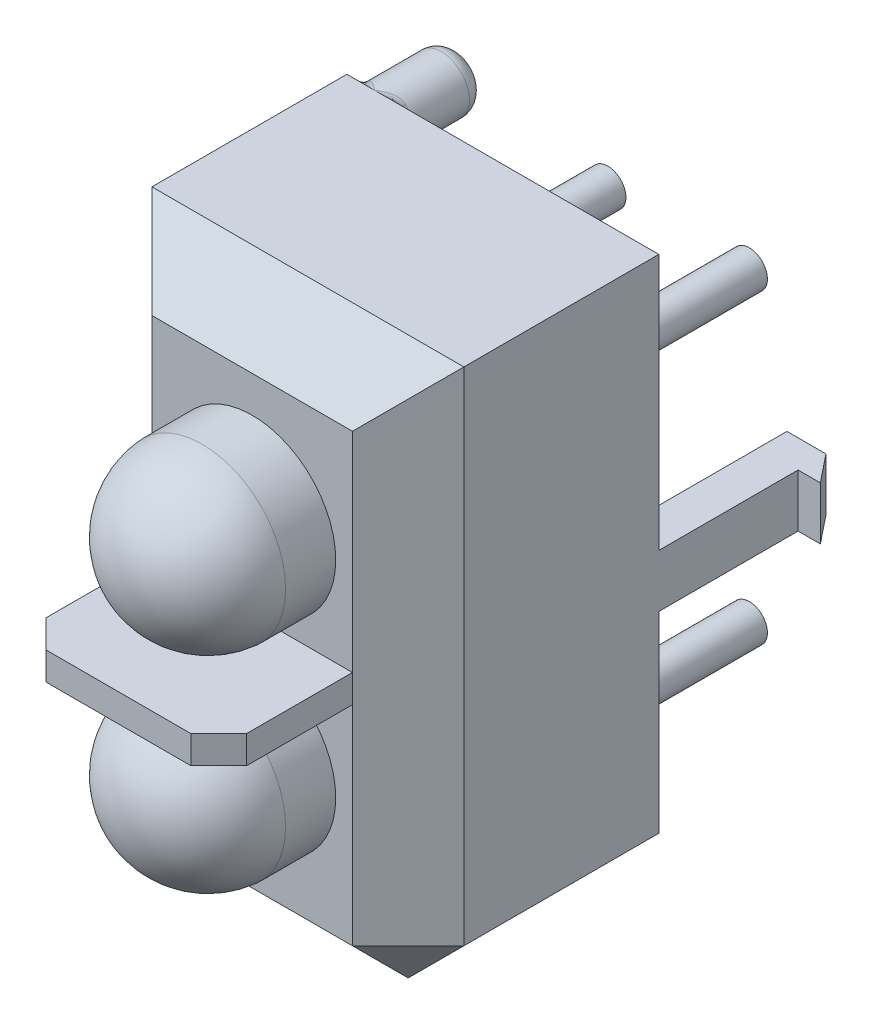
ISO-10303-21;
HEADER;
FILE_DESCRIPTION(('STEP AP214'),'2;1');
FILE_NAME('part.step','',(''),(''),'','','');
FILE_SCHEMA(('AUTOMOTIVE_DESIGN { 1 0 10303 214 1 1 1 1 }'));
ENDSEC;
DATA;
#1=APPLICATION_CONTEXT('core data for automotive mechanical design processes');
#2=APPLICATION_PROTOCOL_DEFINITION('international standard','automotive_design',2000,#1);
#3=PRODUCT_CONTEXT('',#1,'mechanical');
#4=PRODUCT('Part','Part','',(#3));
#5=PRODUCT_RELATED_PRODUCT_CATEGORY('part','',(#4));
#6=PRODUCT_DEFINITION_FORMATION('','',#4);
#7=PRODUCT_DEFINITION_CONTEXT('part definition',#1,'design');
#8=PRODUCT_DEFINITION('design','',#6,#7);
#9=PRODUCT_DEFINITION_SHAPE('','',#8);
#10=(LENGTH_UNIT() NAMED_UNIT(*) SI_UNIT(.MILLI.,.METRE.));
#11=(NAMED_UNIT(*) PLANE_ANGLE_UNIT() SI_UNIT($,.RADIAN.));
#12=(NAMED_UNIT(*) SI_UNIT($,.STERADIAN.) SOLID_ANGLE_UNIT());
#13=UNCERTAINTY_MEASURE_WITH_UNIT(LENGTH_MEASURE(1.E-05),#10,'distance_accuracy_value','');
#14=(GEOMETRIC_REPRESENTATION_CONTEXT(3) GLOBAL_UNCERTAINTY_ASSIGNED_CONTEXT((#13)) GLOBAL_UNIT_ASSIGNED_CONTEXT((#10,
#11,#12)) REPRESENTATION_CONTEXT('',''));
#15=CARTESIAN_POINT('',(0.,0.,0.));
#16=DIRECTION('',(0.,0.,1.));
#17=DIRECTION('',(1.,0.,0.));
#18=AXIS2_PLACEMENT_3D('',#15,#16,#17);
#19=CARTESIAN_POINT('',(1.42499999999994,-2.91,-3.));
#20=DIRECTION('',(0.,0.,1.));
#21=DIRECTION('',(1.,0.,0.));
#22=AXIS2_PLACEMENT_3D('',#19,#20,#21);
#23=CYLINDRICAL_SURFACE('',#22,0.325);
#24=CARTESIAN_POINT('',(1.42499999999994,-2.91,-3.));
#25=DIRECTION('',(0.,0.,-1.));
#26=DIRECTION('',(-1.,0.,0.));
#27=AXIS2_PLACEMENT_3D('',#24,#25,#26);
#28=CIRCLE('',#27,0.325);
#29=CARTESIAN_POINT('',(1.09999999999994,-2.91,-3.));
#30=VERTEX_POINT('',#29);
#31=EDGE_CURVE('E11',#30,#30,#28,.T.);
#32=ORIENTED_EDGE('',*,*,#31,.F.);
#33=EDGE_LOOP('',(#32));
#34=FACE_BOUND('',#33,.T.);
#35=CARTESIAN_POINT('',(1.42499999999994,-2.91,0.));
#36=DIRECTION('',(0.,0.,-1.));
#37=DIRECTION('',(-1.,0.,0.));
#38=AXIS2_PLACEMENT_3D('',#35,#36,#37);
#39=CIRCLE('',#38,0.325);
#40=CARTESIAN_POINT('',(1.09999999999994,-2.91,0.));
#41=VERTEX_POINT('',#40);
#42=EDGE_CURVE('E51',#41,#41,#39,.T.);
#43=ORIENTED_EDGE('',*,*,#42,.T.);
#44=EDGE_LOOP('',(#43));
#45=FACE_BOUND('',#44,.T.);
#46=ADVANCED_FACE('F48',(#34,#45),#23,.T.);
#47=CARTESIAN_POINT('',(1.42499999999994,-2.91,-3.));
#48=DIRECTION('',(0.,0.,-1.));
#49=DIRECTION('',(-1.,0.,0.));
#50=AXIS2_PLACEMENT_3D('',#47,#48,#49);
#51=PLANE('',#50);
#52=ORIENTED_EDGE('',*,*,#31,.T.);
#53=EDGE_LOOP('',(#52));
#54=FACE_BOUND('',#53,.T.);
#55=ADVANCED_FACE('F63',(#54),#51,.T.);
#56=CARTESIAN_POINT('',(1.42499999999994,-2.91,0.));
#57=DIRECTION('',(0.,0.,-1.));
#58=DIRECTION('',(-1.,0.,0.));
#59=AXIS2_PLACEMENT_3D('',#56,#57,#58);
#60=PLANE('',#59);
#61=ORIENTED_EDGE('',*,*,#42,.F.);
#62=EDGE_LOOP('',(#61));
#63=FACE_BOUND('',#62,.T.);
#64=ADVANCED_FACE('F61',(#63),#60,.F.);
#65=CLOSED_SHELL('',(#46,#55,#64));
#66=MANIFOLD_SOLID_BREP('B2',#65);
#67=CARTESIAN_POINT('',(-1.11500000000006,-2.91,-3.));
#68=DIRECTION('',(0.,0.,1.));
#69=DIRECTION('',(1.,0.,0.));
#70=AXIS2_PLACEMENT_3D('',#67,#68,#69);
#71=CYLINDRICAL_SURFACE('',#70,0.325);
#72=CARTESIAN_POINT('',(-1.11500000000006,-2.91,-3.));
#73=DIRECTION('',(0.,0.,-1.));
#74=DIRECTION('',(-1.,0.,0.));
#75=AXIS2_PLACEMENT_3D('',#72,#73,#74);
#76=CIRCLE('',#75,0.325);
#77=CARTESIAN_POINT('',(-1.44000000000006,-2.91,-3.));
#78=VERTEX_POINT('',#77);
#79=EDGE_CURVE('E47',#78,#78,#76,.T.);
#80=ORIENTED_EDGE('',*,*,#79,.F.);
#81=EDGE_LOOP('',(#80));
#82=FACE_BOUND('',#81,.T.);
#83=CARTESIAN_POINT('',(-1.11500000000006,-2.91,0.));
#84=DIRECTION('',(0.,0.,-1.));
#85=DIRECTION('',(-1.,0.,0.));
#86=AXIS2_PLACEMENT_3D('',#83,#84,#85);
#87=CIRCLE('',#86,0.325);
#88=CARTESIAN_POINT('',(-1.44000000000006,-2.91,0.));
#89=VERTEX_POINT('',#88);
#90=EDGE_CURVE('E100',#89,#89,#87,.T.);
#91=ORIENTED_EDGE('',*,*,#90,.T.);
#92=EDGE_LOOP('',(#91));
#93=FACE_BOUND('',#92,.T.);
#94=ADVANCED_FACE('F97',(#82,#93),#71,.T.);
#95=CARTESIAN_POINT('',(-1.11500000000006,-2.91,-3.));
#96=DIRECTION('',(0.,0.,-1.));
#97=DIRECTION('',(-1.,0.,0.));
#98=AXIS2_PLACEMENT_3D('',#95,#96,#97);
#99=PLANE('',#98);
#100=ORIENTED_EDGE('',*,*,#79,.T.);
#101=EDGE_LOOP('',(#100));
#102=FACE_BOUND('',#101,.T.);
#103=ADVANCED_FACE('F112',(#102),#99,.T.);
#104=CARTESIAN_POINT('',(-1.11500000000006,-2.91,0.));
#105=DIRECTION('',(0.,0.,-1.));
#106=DIRECTION('',(-1.,0.,0.));
#107=AXIS2_PLACEMENT_3D('',#104,#105,#106);
#108=PLANE('',#107);
#109=ORIENTED_EDGE('',*,*,#90,.F.);
#110=EDGE_LOOP('',(#109));
#111=FACE_BOUND('',#110,.T.);
#112=ADVANCED_FACE('F110',(#111),#108,.F.);
#113=CLOSED_SHELL('',(#94,#103,#112));
#114=MANIFOLD_SOLID_BREP('B6',#113);
#115=CARTESIAN_POINT('',(-1.115,2.59,-3.));
#116=DIRECTION('',(0.,0.,1.));
#117=DIRECTION('',(1.,0.,0.));
#118=AXIS2_PLACEMENT_3D('',#115,#116,#117);
#119=CYLINDRICAL_SURFACE('',#118,0.325);
#120=CARTESIAN_POINT('',(-1.115,2.59,-3.));
#121=DIRECTION('',(0.,0.,-1.));
#122=DIRECTION('',(-1.,0.,0.));
#123=AXIS2_PLACEMENT_3D('',#120,#121,#122);
#124=CIRCLE('',#123,0.325);
#125=CARTESIAN_POINT('',(-1.44,2.59,-3.));
#126=VERTEX_POINT('',#125);
#127=EDGE_CURVE('E96',#126,#126,#124,.T.);
#128=ORIENTED_EDGE('',*,*,#127,.F.);
#129=EDGE_LOOP('',(#128));
#130=FACE_BOUND('',#129,.T.);
#131=CARTESIAN_POINT('',(-1.115,2.59,0.));
#132=DIRECTION('',(0.,0.,-1.));
#133=DIRECTION('',(-1.,0.,0.));
#134=AXIS2_PLACEMENT_3D('',#131,#132,#133);
#135=CIRCLE('',#134,0.325);
#136=CARTESIAN_POINT('',(-1.44,2.59,0.));
#137=VERTEX_POINT('',#136);
#138=EDGE_CURVE('E149',#137,#137,#135,.T.);
#139=ORIENTED_EDGE('',*,*,#138,.T.);
#140=EDGE_LOOP('',(#139));
#141=FACE_BOUND('',#140,.T.);
#142=ADVANCED_FACE('F146',(#130,#141),#119,.T.);
#143=CARTESIAN_POINT('',(-1.115,2.59,-3.));
#144=DIRECTION('',(0.,0.,-1.));
#145=DIRECTION('',(-1.,0.,0.));
#146=AXIS2_PLACEMENT_3D('',#143,#144,#145);
#147=PLANE('',#146);
#148=ORIENTED_EDGE('',*,*,#127,.T.);
#149=EDGE_LOOP('',(#148));
#150=FACE_BOUND('',#149,.T.);
#151=ADVANCED_FACE('F161',(#150),#147,.T.);
#152=CARTESIAN_POINT('',(-1.115,2.59,0.));
#153=DIRECTION('',(0.,0.,-1.));
#154=DIRECTION('',(-1.,0.,0.));
#155=AXIS2_PLACEMENT_3D('',#152,#153,#154);
#156=PLANE('',#155);
#157=ORIENTED_EDGE('',*,*,#138,.F.);
#158=EDGE_LOOP('',(#157));
#159=FACE_BOUND('',#158,.T.);
#160=ADVANCED_FACE('F159',(#159),#156,.F.);
#161=CLOSED_SHELL('',(#142,#151,#160));
#162=MANIFOLD_SOLID_BREP('B42',#161);
#163=CARTESIAN_POINT('',(1.425,2.59,-3.));
#164=DIRECTION('',(0.,0.,1.));
#165=DIRECTION('',(1.,0.,0.));
#166=AXIS2_PLACEMENT_3D('',#163,#164,#165);
#167=CYLINDRICAL_SURFACE('',#166,0.325);
#168=CARTESIAN_POINT('',(1.425,2.59,-3.));
#169=DIRECTION('',(0.,0.,-1.));
#170=DIRECTION('',(-1.,0.,0.));
#171=AXIS2_PLACEMENT_3D('',#168,#169,#170);
#172=CIRCLE('',#171,0.325);
#173=CARTESIAN_POINT('',(1.1,2.59,-3.));
#174=VERTEX_POINT('',#173);
#175=EDGE_CURVE('E145',#174,#174,#172,.T.);
#176=ORIENTED_EDGE('',*,*,#175,.F.);
#177=EDGE_LOOP('',(#176));
#178=FACE_BOUND('',#177,.T.);
#179=CARTESIAN_POINT('',(1.425,2.59,0.));
#180=DIRECTION('',(0.,0.,-1.));
#181=DIRECTION('',(-1.,0.,0.));
#182=AXIS2_PLACEMENT_3D('',#179,#180,#181);
#183=CIRCLE('',#182,0.325);
#184=CARTESIAN_POINT('',(1.1,2.59,0.));
#185=VERTEX_POINT('',#184);
#186=EDGE_CURVE('E199',#185,#185,#183,.T.);
#187=ORIENTED_EDGE('',*,*,#186,.T.);
#188=EDGE_LOOP('',(#187));
#189=FACE_BOUND('',#188,.T.);
#190=ADVANCED_FACE('F196',(#178,#189),#167,.T.);
#191=CARTESIAN_POINT('',(1.425,2.59,-3.));
#192=DIRECTION('',(0.,0.,-1.));
#193=DIRECTION('',(-1.,0.,0.));
#194=AXIS2_PLACEMENT_3D('',#191,#192,#193);
#195=PLANE('',#194);
#196=ORIENTED_EDGE('',*,*,#175,.T.);
#197=EDGE_LOOP('',(#196));
#198=FACE_BOUND('',#197,.T.);
#199=ADVANCED_FACE('F211',(#198),#195,.T.);
#200=CARTESIAN_POINT('',(1.425,2.59,0.));
#201=DIRECTION('',(0.,0.,-1.));
#202=DIRECTION('',(-1.,0.,0.));
#203=AXIS2_PLACEMENT_3D('',#200,#201,#202);
#204=PLANE('',#203);
#205=ORIENTED_EDGE('',*,*,#186,.F.);
#206=EDGE_LOOP('',(#205));
#207=FACE_BOUND('',#206,.T.);
#208=ADVANCED_FACE('F209',(#207),#204,.F.);
#209=CLOSED_SHELL('',(#190,#199,#208));
#210=MANIFOLD_SOLID_BREP('B91',#209);
#211=CARTESIAN_POINT('',(-2.8,-0.552061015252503,-3.));
#212=DIRECTION('',(0.,1.,0.));
#213=DIRECTION('',(-1.,0.,0.));
#214=AXIS2_PLACEMENT_3D('',#211,#212,#213);
#215=PLANE('',#214);
#216=DIRECTION('',(-0.624695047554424,0.,0.78086880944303));
#217=VECTOR('',#216,1.);
#218=CARTESIAN_POINT('',(-2.8,-0.552061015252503,-3.));
#219=LINE('',#218,#217);
#220=CARTESIAN_POINT('',(-2.8,-0.552061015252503,-3.));
#221=VERTEX_POINT('',#220);
#222=CARTESIAN_POINT('',(-3.2,-0.552061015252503,-2.5));
#223=VERTEX_POINT('',#222);
#224=EDGE_CURVE('E267',#221,#223,#219,.T.);
#225=ORIENTED_EDGE('',*,*,#224,.F.);
#226=DIRECTION('',(-1.,0.,0.));
#227=VECTOR('',#226,1.);
#228=CARTESIAN_POINT('',(-2.8,-0.552061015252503,-3.));
#229=LINE('',#228,#227);
#230=CARTESIAN_POINT('',(-2.1,-0.552061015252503,-3.));
#231=VERTEX_POINT('',#230);
#232=EDGE_CURVE('E1489',#231,#221,#229,.T.);
#233=ORIENTED_EDGE('',*,*,#232,.F.);
#234=DIRECTION('',(0.,0.,1.));
#235=VECTOR('',#234,1.);
#236=CARTESIAN_POINT('',(-2.1,-0.552061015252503,-3.));
#237=LINE('',#236,#235);
#238=CARTESIAN_POINT('',(-2.1,-0.552061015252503,0.));
#239=VERTEX_POINT('',#238);
#240=EDGE_CURVE('E552',#231,#239,#237,.T.);
#241=ORIENTED_EDGE('',*,*,#240,.T.);
#242=DIRECTION('',(-1.,0.,0.));
#243=VECTOR('',#242,1.);
#244=CARTESIAN_POINT('',(-2.8,-0.552061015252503,0.));
#245=LINE('',#244,#243);
#246=CARTESIAN_POINT('',(-2.8,-0.552061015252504,0.));
#247=VERTEX_POINT('',#246);
#248=EDGE_CURVE('E530',#239,#247,#245,.T.);
#249=ORIENTED_EDGE('',*,*,#248,.T.);
#250=DIRECTION('',(0.,0.,1.));
#251=VECTOR('',#250,1.);
#252=CARTESIAN_POINT('',(-2.8,-0.552061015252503,-3.));
#253=LINE('',#252,#251);
#254=CARTESIAN_POINT('',(-2.8,-0.552061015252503,-2.5));
#255=VERTEX_POINT('',#254);
#256=EDGE_CURVE('E549',#255,#247,#253,.T.);
#257=ORIENTED_EDGE('',*,*,#256,.F.);
#258=DIRECTION('',(1.,0.,0.));
#259=VECTOR('',#258,1.);
#260=CARTESIAN_POINT('',(-3.2,-0.552061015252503,-2.5));
#261=LINE('',#260,#259);
#262=EDGE_CURVE('E468',#223,#255,#261,.T.);
#263=ORIENTED_EDGE('',*,*,#262,.F.);
#264=EDGE_LOOP('',(#225,#233,#241,#249,#257,#263));
#265=FACE_BOUND('',#264,.T.);
#266=ADVANCED_FACE('F237',(#265),#215,.F.);
#267=CARTESIAN_POINT('',(-2.8,0.397938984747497,-3.));
#268=DIRECTION('',(0.,-1.,0.));
#269=DIRECTION('',(0.,0.,-1.));
#270=AXIS2_PLACEMENT_3D('',#267,#268,#269);
#271=PLANE('',#270);
#272=DIRECTION('',(0.624695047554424,0.,-0.78086880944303));
#273=VECTOR('',#272,1.);
#274=CARTESIAN_POINT('',(-2.8,0.397938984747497,-3.));
#275=LINE('',#274,#273);
#276=CARTESIAN_POINT('',(-3.2,0.397938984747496,-2.5));
#277=VERTEX_POINT('',#276);
#278=CARTESIAN_POINT('',(-2.8,0.397938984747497,-3.));
#279=VERTEX_POINT('',#278);
#280=EDGE_CURVE('E471',#277,#279,#275,.T.);
#281=ORIENTED_EDGE('',*,*,#280,.F.);
#282=DIRECTION('',(1.,0.,0.));
#283=VECTOR('',#282,1.);
#284=CARTESIAN_POINT('',(-3.2,0.397938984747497,-2.5));
#285=LINE('',#284,#283);
#286=CARTESIAN_POINT('',(-2.8,0.397938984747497,-2.5));
#287=VERTEX_POINT('',#286);
#288=EDGE_CURVE('E458',#277,#287,#285,.T.);
#289=ORIENTED_EDGE('',*,*,#288,.T.);
#290=DIRECTION('',(0.,0.,1.));
#291=VECTOR('',#290,1.);
#292=CARTESIAN_POINT('',(-2.8,0.397938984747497,-3.));
#293=LINE('',#292,#291);
#294=CARTESIAN_POINT('',(-2.8,0.397938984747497,0.));
#295=VERTEX_POINT('',#294);
#296=EDGE_CURVE('E546',#287,#295,#293,.T.);
#297=ORIENTED_EDGE('',*,*,#296,.T.);
#298=DIRECTION('',(1.,0.,0.));
#299=VECTOR('',#298,1.);
#300=CARTESIAN_POINT('',(-2.8,0.397938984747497,0.));
#301=LINE('',#300,#299);
#302=CARTESIAN_POINT('',(-2.1,0.397938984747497,0.));
#303=VERTEX_POINT('',#302);
#304=EDGE_CURVE('E538',#295,#303,#301,.T.);
#305=ORIENTED_EDGE('',*,*,#304,.T.);
#306=DIRECTION('',(0.,0.,1.));
#307=VECTOR('',#306,1.);
#308=CARTESIAN_POINT('',(-2.1,0.397938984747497,-3.));
#309=LINE('',#308,#307);
#310=CARTESIAN_POINT('',(-2.1,0.397938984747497,-3.));
#311=VERTEX_POINT('',#310);
#312=EDGE_CURVE('E543',#311,#303,#309,.T.);
#313=ORIENTED_EDGE('',*,*,#312,.F.);
#314=DIRECTION('',(1.,0.,0.));
#315=VECTOR('',#314,1.);
#316=CARTESIAN_POINT('',(-2.8,0.397938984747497,-3.));
#317=LINE('',#316,#315);
#318=EDGE_CURVE('E474',#279,#311,#317,.T.);
#319=ORIENTED_EDGE('',*,*,#318,.F.);
#320=EDGE_LOOP('',(#281,#289,#297,#305,#313,#319));
#321=FACE_BOUND('',#320,.T.);
#322=ADVANCED_FACE('F472',(#321),#271,.F.);
#323=CARTESIAN_POINT('',(0.,0.,-3.));
#324=DIRECTION('',(0.,0.,-1.));
#325=DIRECTION('',(-1.,0.,0.));
#326=AXIS2_PLACEMENT_3D('',#323,#324,#325);
#327=PLANE('',#326);
#328=ORIENTED_EDGE('',*,*,#232,.T.);
#329=DIRECTION('',(0.,-1.,0.));
#330=VECTOR('',#329,1.);
#331=CARTESIAN_POINT('',(-2.8,23.8561938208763,-3.));
#332=LINE('',#331,#330);
#333=EDGE_CURVE('E257',#279,#221,#332,.T.);
#334=ORIENTED_EDGE('',*,*,#333,.F.);
#335=ORIENTED_EDGE('',*,*,#318,.T.);
#336=DIRECTION('',(0.,-1.,0.));
#337=VECTOR('',#336,1.);
#338=CARTESIAN_POINT('',(-2.1,-0.552061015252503,-3.));
#339=LINE('',#338,#337);
#340=EDGE_CURVE('E508',#311,#231,#339,.T.);
#341=ORIENTED_EDGE('',*,*,#340,.T.);
#342=EDGE_LOOP('',(#328,#334,#335,#341));
#343=FACE_BOUND('',#342,.T.);
#344=ADVANCED_FACE('F707',(#343),#327,.T.);
#345=CARTESIAN_POINT('',(-2.8,5.,4.5));
#346=DIRECTION('',(1.,0.,0.));
#347=DIRECTION('',(0.,1.,0.));
#348=AXIS2_PLACEMENT_3D('',#345,#346,#347);
#349=PLANE('',#348);
#350=DIRECTION('',(0.,1.,0.));
#351=VECTOR('',#350,1.);
#352=CARTESIAN_POINT('',(-2.8,0.397938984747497,-2.5));
#353=LINE('',#352,#351);
#354=EDGE_CURVE('E464',#255,#287,#353,.T.);
#355=ORIENTED_EDGE('',*,*,#354,.F.);
#356=ORIENTED_EDGE('',*,*,#256,.T.);
#357=DIRECTION('',(0.,-1.,0.));
#358=VECTOR('',#357,1.);
#359=CARTESIAN_POINT('',(-2.8,5.,0.));
#360=LINE('',#359,#358);
#361=CARTESIAN_POINT('',(-2.8,-4.,0.));
#362=VERTEX_POINT('',#361);
#363=EDGE_CURVE('E811',#247,#362,#360,.T.);
#364=ORIENTED_EDGE('',*,*,#363,.T.);
#365=DIRECTION('',(0.,0.,1.));
#366=VECTOR('',#365,1.);
#367=CARTESIAN_POINT('',(-2.8,-4.,4.5));
#368=LINE('',#367,#366);
#369=CARTESIAN_POINT('',(-2.8,-4.,3.5));
#370=VERTEX_POINT('',#369);
#371=EDGE_CURVE('E846',#362,#370,#368,.T.);
#372=ORIENTED_EDGE('',*,*,#371,.T.);
#373=DIRECTION('',(0.,1.,0.));
#374=VECTOR('',#373,1.);
#375=CARTESIAN_POINT('',(-2.8,5.,3.5));
#376=LINE('',#375,#374);
#377=CARTESIAN_POINT('',(-2.8,5.,3.5));
#378=VERTEX_POINT('',#377);
#379=EDGE_CURVE('E863',#370,#378,#376,.T.);
#380=ORIENTED_EDGE('',*,*,#379,.T.);
#381=DIRECTION('',(0.,0.,-1.));
#382=VECTOR('',#381,1.);
#383=CARTESIAN_POINT('',(-2.8,5.,4.5));
#384=LINE('',#383,#382);
#385=CARTESIAN_POINT('',(-2.8,5.,0.));
#386=VERTEX_POINT('',#385);
#387=EDGE_CURVE('E842',#378,#386,#384,.T.);
#388=ORIENTED_EDGE('',*,*,#387,.T.);
#389=CARTESIAN_POINT('',(-2.8,4.98989794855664,0.));
#390=VERTEX_POINT('',#389);
#391=EDGE_CURVE('E835',#386,#390,#360,.T.);
#392=ORIENTED_EDGE('',*,*,#391,.T.);
#393=CARTESIAN_POINT('',(-2.8,4.5,0.));
#394=VERTEX_POINT('',#393);
#395=EDGE_CURVE('E826',#390,#394,#360,.T.);
#396=ORIENTED_EDGE('',*,*,#395,.T.);
#397=CARTESIAN_POINT('',(-2.8,4.01010205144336,0.));
#398=VERTEX_POINT('',#397);
#399=EDGE_CURVE('E832',#394,#398,#360,.T.);
#400=ORIENTED_EDGE('',*,*,#399,.T.);
#401=EDGE_CURVE('E799',#398,#295,#360,.T.);
#402=ORIENTED_EDGE('',*,*,#401,.T.);
#403=ORIENTED_EDGE('',*,*,#296,.F.);
#404=EDGE_LOOP('',(#355,#356,#364,#372,#380,#388,#392,#396,#400,#402,#403));
#405=FACE_BOUND('',#404,.T.);
#406=ADVANCED_FACE('F618',(#405),#349,.F.);
#407=CARTESIAN_POINT('',(2.1,-0.552061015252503,-3.));
#408=DIRECTION('',(0.,1.,0.));
#409=DIRECTION('',(-1.,0.,0.));
#410=AXIS2_PLACEMENT_3D('',#407,#408,#409);
#411=PLANE('',#410);
#412=DIRECTION('',(-0.624695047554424,0.,-0.78086880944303));
#413=VECTOR('',#412,1.);
#414=CARTESIAN_POINT('',(2.52682926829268,-0.552061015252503,-3.34146341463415));
#415=LINE('',#414,#413);
#416=CARTESIAN_POINT('',(3.2,-0.552061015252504,-2.5));
#417=VERTEX_POINT('',#416);
#418=CARTESIAN_POINT('',(2.8,-0.552061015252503,-3.));
#419=VERTEX_POINT('',#418);
#420=EDGE_CURVE('E496',#417,#419,#415,.T.);
#421=ORIENTED_EDGE('',*,*,#420,.F.);
#422=DIRECTION('',(-1.,0.,0.));
#423=VECTOR('',#422,1.);
#424=CARTESIAN_POINT('',(3.2,-0.552061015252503,-2.5));
#425=LINE('',#424,#423);
#426=CARTESIAN_POINT('',(2.8,-0.552061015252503,-2.5));
#427=VERTEX_POINT('',#426);
#428=EDGE_CURVE('E505',#417,#427,#425,.T.);
#429=ORIENTED_EDGE('',*,*,#428,.T.);
#430=DIRECTION('',(0.,0.,1.));
#431=VECTOR('',#430,1.);
#432=CARTESIAN_POINT('',(2.8,-0.552061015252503,-3.));
#433=LINE('',#432,#431);
#434=CARTESIAN_POINT('',(2.8,-0.552061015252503,0.));
#435=VERTEX_POINT('',#434);
#436=EDGE_CURVE('E581',#427,#435,#433,.T.);
#437=ORIENTED_EDGE('',*,*,#436,.T.);
#438=DIRECTION('',(-1.,0.,0.));
#439=VECTOR('',#438,1.);
#440=CARTESIAN_POINT('',(2.1,-0.552061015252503,0.));
#441=LINE('',#440,#439);
#442=CARTESIAN_POINT('',(2.1,-0.552061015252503,0.));
#443=VERTEX_POINT('',#442);
#444=EDGE_CURVE('E555',#435,#443,#441,.T.);
#445=ORIENTED_EDGE('',*,*,#444,.T.);
#446=DIRECTION('',(0.,0.,1.));
#447=VECTOR('',#446,1.);
#448=CARTESIAN_POINT('',(2.1,-0.552061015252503,-3.));
#449=LINE('',#448,#447);
#450=CARTESIAN_POINT('',(2.1,-0.552061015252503,-3.));
#451=VERTEX_POINT('',#450);
#452=EDGE_CURVE('E577',#451,#443,#449,.T.);
#453=ORIENTED_EDGE('',*,*,#452,.F.);
#454=DIRECTION('',(-1.,0.,0.));
#455=VECTOR('',#454,1.);
#456=CARTESIAN_POINT('',(2.1,-0.552061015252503,-3.));
#457=LINE('',#456,#455);
#458=EDGE_CURVE('E556',#419,#451,#457,.T.);
#459=ORIENTED_EDGE('',*,*,#458,.F.);
#460=EDGE_LOOP('',(#421,#429,#437,#445,#453,#459));
#461=FACE_BOUND('',#460,.T.);
#462=ADVANCED_FACE('F722',(#461),#411,.F.);
#463=CARTESIAN_POINT('',(2.1,0.397938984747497,-3.));
#464=DIRECTION('',(0.,-1.,0.));
#465=DIRECTION('',(0.,0.,-1.));
#466=AXIS2_PLACEMENT_3D('',#463,#464,#465);
#467=PLANE('',#466);
#468=DIRECTION('',(0.624695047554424,0.,0.78086880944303));
#469=VECTOR('',#468,1.);
#470=CARTESIAN_POINT('',(2.52682926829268,0.397938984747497,-3.34146341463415));
#471=LINE('',#470,#469);
#472=CARTESIAN_POINT('',(2.8,0.397938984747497,-3.));
#473=VERTEX_POINT('',#472);
#474=CARTESIAN_POINT('',(3.2,0.397938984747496,-2.5));
#475=VERTEX_POINT('',#474);
#476=EDGE_CURVE('E492',#473,#475,#471,.T.);
#477=ORIENTED_EDGE('',*,*,#476,.F.);
#478=DIRECTION('',(1.,0.,0.));
#479=VECTOR('',#478,1.);
#480=CARTESIAN_POINT('',(2.1,0.397938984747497,-3.));
#481=LINE('',#480,#479);
#482=CARTESIAN_POINT('',(2.1,0.397938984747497,-3.));
#483=VERTEX_POINT('',#482);
#484=EDGE_CURVE('E563',#483,#473,#481,.T.);
#485=ORIENTED_EDGE('',*,*,#484,.F.);
#486=DIRECTION('',(0.,0.,1.));
#487=VECTOR('',#486,1.);
#488=CARTESIAN_POINT('',(2.1,0.397938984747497,-3.));
#489=LINE('',#488,#487);
#490=CARTESIAN_POINT('',(2.1,0.397938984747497,0.));
#491=VERTEX_POINT('',#490);
#492=EDGE_CURVE('E573',#483,#491,#489,.T.);
#493=ORIENTED_EDGE('',*,*,#492,.T.);
#494=DIRECTION('',(1.,0.,0.));
#495=VECTOR('',#494,1.);
#496=CARTESIAN_POINT('',(2.1,0.397938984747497,0.));
#497=LINE('',#496,#495);
#498=CARTESIAN_POINT('',(2.8,0.397938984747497,0.));
#499=VERTEX_POINT('',#498);
#500=EDGE_CURVE('E560',#491,#499,#497,.T.);
#501=ORIENTED_EDGE('',*,*,#500,.T.);
#502=DIRECTION('',(0.,0.,1.));
#503=VECTOR('',#502,1.);
#504=CARTESIAN_POINT('',(2.8,0.397938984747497,-3.));
#505=LINE('',#504,#503);
#506=CARTESIAN_POINT('',(2.8,0.397938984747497,-2.5));
#507=VERTEX_POINT('',#506);
#508=EDGE_CURVE('E515',#507,#499,#505,.T.);
#509=ORIENTED_EDGE('',*,*,#508,.F.);
#510=DIRECTION('',(-1.,0.,0.));
#511=VECTOR('',#510,1.);
#512=CARTESIAN_POINT('',(3.2,0.397938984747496,-2.5));
#513=LINE('',#512,#511);
#514=EDGE_CURVE('E521',#475,#507,#513,.T.);
#515=ORIENTED_EDGE('',*,*,#514,.F.);
#516=EDGE_LOOP('',(#477,#485,#493,#501,#509,#515));
#517=FACE_BOUND('',#516,.T.);
#518=ADVANCED_FACE('F718',(#517),#467,.F.);
#519=CARTESIAN_POINT('',(0.,0.,-3.));
#520=DIRECTION('',(0.,0.,-1.));
#521=DIRECTION('',(-1.,0.,0.));
#522=AXIS2_PLACEMENT_3D('',#519,#520,#521);
#523=PLANE('',#522);
#524=ORIENTED_EDGE('',*,*,#484,.T.);
#525=DIRECTION('',(0.,1.,0.));
#526=VECTOR('',#525,1.);
#527=CARTESIAN_POINT('',(2.8,-23.6013812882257,-3.));
#528=LINE('',#527,#526);
#529=EDGE_CURVE('E488',#419,#473,#528,.T.);
#530=ORIENTED_EDGE('',*,*,#529,.F.);
#531=ORIENTED_EDGE('',*,*,#458,.T.);
#532=DIRECTION('',(0.,1.,0.));
#533=VECTOR('',#532,1.);
#534=CARTESIAN_POINT('',(2.1,-0.552061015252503,-3.));
#535=LINE('',#534,#533);
#536=EDGE_CURVE('E559',#451,#483,#535,.T.);
#537=ORIENTED_EDGE('',*,*,#536,.T.);
#538=EDGE_LOOP('',(#524,#530,#531,#537));
#539=FACE_BOUND('',#538,.T.);
#540=ADVANCED_FACE('F715',(#539),#523,.T.);
#541=CARTESIAN_POINT('',(2.8,5.,4.5));
#542=DIRECTION('',(-1.,0.,0.));
#543=DIRECTION('',(0.,0.,1.));
#544=AXIS2_PLACEMENT_3D('',#541,#542,#543);
#545=PLANE('',#544);
#546=DIRECTION('',(0.,-1.,0.));
#547=VECTOR('',#546,1.);
#548=CARTESIAN_POINT('',(2.8,0.397938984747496,-2.5));
#549=LINE('',#548,#547);
#550=EDGE_CURVE('E500',#507,#427,#549,.T.);
#551=ORIENTED_EDGE('',*,*,#550,.F.);
#552=ORIENTED_EDGE('',*,*,#508,.T.);
#553=DIRECTION('',(0.,1.,0.));
#554=VECTOR('',#553,1.);
#555=CARTESIAN_POINT('',(2.8,5.,0.));
#556=LINE('',#555,#554);
#557=CARTESIAN_POINT('',(2.8,5.,0.));
#558=VERTEX_POINT('',#557);
#559=EDGE_CURVE('E905',#499,#558,#556,.T.);
#560=ORIENTED_EDGE('',*,*,#559,.T.);
#561=DIRECTION('',(0.,0.,-1.));
#562=VECTOR('',#561,1.);
#563=CARTESIAN_POINT('',(2.8,5.,4.5));
#564=LINE('',#563,#562);
#565=CARTESIAN_POINT('',(2.8,5.,3.5));
#566=VERTEX_POINT('',#565);
#567=EDGE_CURVE('E809',#566,#558,#564,.T.);
#568=ORIENTED_EDGE('',*,*,#567,.F.);
#569=DIRECTION('',(0.,-1.,0.));
#570=VECTOR('',#569,1.);
#571=CARTESIAN_POINT('',(2.8,-5.,3.5));
#572=LINE('',#571,#570);
#573=CARTESIAN_POINT('',(2.8,-3.99999999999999,3.5));
#574=VERTEX_POINT('',#573);
#575=EDGE_CURVE('E998',#566,#574,#572,.T.);
#576=ORIENTED_EDGE('',*,*,#575,.T.);
#577=DIRECTION('',(0.,0.,-1.));
#578=VECTOR('',#577,1.);
#579=CARTESIAN_POINT('',(2.8,-3.99999999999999,4.5));
#580=LINE('',#579,#578);
#581=CARTESIAN_POINT('',(2.8,-3.99999999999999,0.));
#582=VERTEX_POINT('',#581);
#583=EDGE_CURVE('E855',#574,#582,#580,.T.);
#584=ORIENTED_EDGE('',*,*,#583,.T.);
#585=EDGE_CURVE('E967',#582,#435,#556,.T.);
#586=ORIENTED_EDGE('',*,*,#585,.T.);
#587=ORIENTED_EDGE('',*,*,#436,.F.);
#588=EDGE_LOOP('',(#551,#552,#560,#568,#576,#584,#586,#587));
#589=FACE_BOUND('',#588,.T.);
#590=ADVANCED_FACE('F620',(#589),#545,.F.);
#591=CARTESIAN_POINT('',(2.8,-5.,0.));
#592=DIRECTION('',(0.,0.,1.));
#593=DIRECTION('',(1.,0.,0.));
#594=AXIS2_PLACEMENT_3D('',#591,#592,#593);
#595=PLANE('',#594);
#596=ORIENTED_EDGE('',*,*,#248,.F.);
#597=DIRECTION('',(0.,-1.,0.));
#598=VECTOR('',#597,1.);
#599=CARTESIAN_POINT('',(-2.1,-0.552061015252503,0.));
#600=LINE('',#599,#598);
#601=EDGE_CURVE('E525',#303,#239,#600,.T.);
#602=ORIENTED_EDGE('',*,*,#601,.F.);
#603=ORIENTED_EDGE('',*,*,#304,.F.);
#604=ORIENTED_EDGE('',*,*,#401,.F.);
#605=CARTESIAN_POINT('',(-2.3,4.5,0.));
#606=DIRECTION('',(0.,0.,1.));
#607=DIRECTION('',(1.,0.,0.));
#608=AXIS2_PLACEMENT_3D('',#605,#606,#607);
#609=CIRCLE('',#608,0.7);
#610=CARTESIAN_POINT('',(-1.81010205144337,5.,0.));
#611=VERTEX_POINT('',#610);
#612=EDGE_CURVE('E246',#398,#611,#609,.T.);
#613=ORIENTED_EDGE('',*,*,#612,.T.);
#614=DIRECTION('',(-1.,0.,0.));
#615=VECTOR('',#614,1.);
#616=CARTESIAN_POINT('',(-2.8,5.,0.));
#617=LINE('',#616,#615);
#618=EDGE_CURVE('E796',#558,#611,#617,.T.);
#619=ORIENTED_EDGE('',*,*,#618,.F.);
#620=ORIENTED_EDGE('',*,*,#559,.F.);
#621=ORIENTED_EDGE('',*,*,#500,.F.);
#622=DIRECTION('',(0.,1.,0.));
#623=VECTOR('',#622,1.);
#624=CARTESIAN_POINT('',(2.1,-0.552061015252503,0.));
#625=LINE('',#624,#623);
#626=EDGE_CURVE('E568',#443,#491,#625,.T.);
#627=ORIENTED_EDGE('',*,*,#626,.F.);
#628=ORIENTED_EDGE('',*,*,#444,.F.);
#629=ORIENTED_EDGE('',*,*,#585,.F.);
#630=DIRECTION('',(0.707106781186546,0.707106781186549,0.));
#631=VECTOR('',#630,1.);
#632=CARTESIAN_POINT('',(2.8,-3.99999999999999,0.));
#633=LINE('',#632,#631);
#634=CARTESIAN_POINT('',(1.8,-5.,0.));
#635=VERTEX_POINT('',#634);
#636=EDGE_CURVE('E854',#582,#635,#633,.F.);
#637=ORIENTED_EDGE('',*,*,#636,.T.);
#638=DIRECTION('',(1.,0.,0.));
#639=VECTOR('',#638,1.);
#640=CARTESIAN_POINT('',(-2.8,-5.,0.));
#641=LINE('',#640,#639);
#642=CARTESIAN_POINT('',(-1.79999999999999,-5.,0.));
#643=VERTEX_POINT('',#642);
#644=EDGE_CURVE('E838',#643,#635,#641,.T.);
#645=ORIENTED_EDGE('',*,*,#644,.F.);
#646=DIRECTION('',(0.707106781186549,-0.707106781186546,0.));
#647=VECTOR('',#646,1.);
#648=CARTESIAN_POINT('',(-1.79999999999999,-5.,0.));
#649=LINE('',#648,#647);
#650=EDGE_CURVE('E851',#643,#362,#649,.F.);
#651=ORIENTED_EDGE('',*,*,#650,.T.);
#652=ORIENTED_EDGE('',*,*,#363,.F.);
#653=EDGE_LOOP('',(#596,#602,#603,#604,#613,#619,#620,#621,#627,#628,#629,#637,#645,#651,#652));
#654=FACE_BOUND('',#653,.T.);
#655=ADVANCED_FACE('F794',(#654),#595,.F.);
#656=CARTESIAN_POINT('',(-2.78989794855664,5.,0.));
#657=VERTEX_POINT('',#656);
#658=EDGE_CURVE('E813',#657,#386,#617,.T.);
#659=ORIENTED_EDGE('',*,*,#658,.F.);
#660=CARTESIAN_POINT('',(-2.3,4.5,0.));
#661=DIRECTION('',(0.,0.,1.));
#662=DIRECTION('',(1.,0.,0.));
#663=AXIS2_PLACEMENT_3D('',#660,#661,#662);
#664=CIRCLE('',#663,0.7);
#665=EDGE_CURVE('E194',#657,#390,#664,.T.);
#666=ORIENTED_EDGE('',*,*,#665,.T.);
#667=ORIENTED_EDGE('',*,*,#391,.F.);
#668=EDGE_LOOP('',(#659,#666,#667));
#669=FACE_BOUND('',#668,.T.);
#670=ADVANCED_FACE('F606',(#669),#595,.F.);
#671=CARTESIAN_POINT('',(2.8,-5.,4.5));
#672=DIRECTION('',(0.,0.,1.));
#673=DIRECTION('',(1.,0.,0.));
#674=AXIS2_PLACEMENT_3D('',#671,#672,#673);
#675=PLANE('',#674);
#676=CARTESIAN_POINT('',(0.,1.85,4.5));
#677=DIRECTION('',(0.,0.,1.));
#678=DIRECTION('',(1.,0.,0.));
#679=AXIS2_PLACEMENT_3D('',#676,#677,#678);
#680=CIRCLE('',#679,1.5);
#681=CARTESIAN_POINT('',(1.5,1.85,4.5));
#682=VERTEX_POINT('',#681);
#683=EDGE_CURVE('E908',#682,#682,#680,.T.);
#684=ORIENTED_EDGE('',*,*,#683,.F.);
#685=EDGE_LOOP('',(#684));
#686=FACE_BOUND('',#685,.T.);
#687=DIRECTION('',(0.,-1.,0.));
#688=VECTOR('',#687,1.);
#689=CARTESIAN_POINT('',(-1.79999999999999,-5.,4.5));
#690=LINE('',#689,#688);
#691=CARTESIAN_POINT('',(-1.8,4.,4.5));
#692=VERTEX_POINT('',#691);
#693=CARTESIAN_POINT('',(-1.8,0.25,4.5));
#694=VERTEX_POINT('',#693);
#695=EDGE_CURVE('E865',#692,#694,#690,.T.);
#696=ORIENTED_EDGE('',*,*,#695,.T.);
#697=DIRECTION('',(-1.,0.,0.));
#698=VECTOR('',#697,1.);
#699=CARTESIAN_POINT('',(-1.8,0.25,4.5));
#700=LINE('',#699,#698);
#701=CARTESIAN_POINT('',(1.8,0.25,4.5));
#702=VERTEX_POINT('',#701);
#703=EDGE_CURVE('E1421',#702,#694,#700,.T.);
#704=ORIENTED_EDGE('',*,*,#703,.F.);
#705=DIRECTION('',(0.,1.,0.));
#706=VECTOR('',#705,1.);
#707=CARTESIAN_POINT('',(1.8,5.,4.5));
#708=LINE('',#707,#706);
#709=CARTESIAN_POINT('',(1.8,4.,4.5));
#710=VERTEX_POINT('',#709);
#711=EDGE_CURVE('E876',#702,#710,#708,.T.);
#712=ORIENTED_EDGE('',*,*,#711,.T.);
#713=DIRECTION('',(-1.,0.,0.));
#714=VECTOR('',#713,1.);
#715=CARTESIAN_POINT('',(-2.8,4.,4.5));
#716=LINE('',#715,#714);
#717=EDGE_CURVE('E872',#710,#692,#716,.T.);
#718=ORIENTED_EDGE('',*,*,#717,.T.);
#719=EDGE_LOOP('',(#696,#704,#712,#718));
#720=FACE_BOUND('',#719,.T.);
#721=ADVANCED_FACE('F1005',(#686,#720),#675,.T.);
#722=CARTESIAN_POINT('',(0.,-1.85,4.5));
#723=DIRECTION('',(0.,0.,1.));
#724=DIRECTION('',(1.,0.,0.));
#725=AXIS2_PLACEMENT_3D('',#722,#723,#724);
#726=CIRCLE('',#725,1.5);
#727=CARTESIAN_POINT('',(1.5,-1.85,4.5));
#728=VERTEX_POINT('',#727);
#729=EDGE_CURVE('E912',#728,#728,#726,.T.);
#730=ORIENTED_EDGE('',*,*,#729,.F.);
#731=EDGE_LOOP('',(#730));
#732=FACE_BOUND('',#731,.T.);
#733=CARTESIAN_POINT('',(1.8,-3.99999999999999,4.5));
#734=VERTEX_POINT('',#733);
#735=CARTESIAN_POINT('',(1.8,-0.25,4.5));
#736=VERTEX_POINT('',#735);
#737=EDGE_CURVE('E877',#734,#736,#708,.T.);
#738=ORIENTED_EDGE('',*,*,#737,.T.);
#739=DIRECTION('',(1.,0.,0.));
#740=VECTOR('',#739,1.);
#741=CARTESIAN_POINT('',(-1.8,-0.25,4.5));
#742=LINE('',#741,#740);
#743=CARTESIAN_POINT('',(-1.8,-0.25,4.5));
#744=VERTEX_POINT('',#743);
#745=EDGE_CURVE('E942',#744,#736,#742,.T.);
#746=ORIENTED_EDGE('',*,*,#745,.F.);
#747=CARTESIAN_POINT('',(-1.79999999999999,-3.99999999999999,4.5));
#748=VERTEX_POINT('',#747);
#749=EDGE_CURVE('E862',#744,#748,#690,.T.);
#750=ORIENTED_EDGE('',*,*,#749,.T.);
#751=DIRECTION('',(1.,0.,0.));
#752=VECTOR('',#751,1.);
#753=CARTESIAN_POINT('',(2.8,-3.99999999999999,4.5));
#754=LINE('',#753,#752);
#755=EDGE_CURVE('E874',#748,#734,#754,.T.);
#756=ORIENTED_EDGE('',*,*,#755,.T.);
#757=EDGE_LOOP('',(#738,#746,#750,#756));
#758=FACE_BOUND('',#757,.T.);
#759=ADVANCED_FACE('F616',(#732,#758),#675,.T.);
#760=CARTESIAN_POINT('',(-2.8,5.,4.5));
#761=DIRECTION('',(0.,-1.,0.));
#762=DIRECTION('',(0.,0.,-1.));
#763=AXIS2_PLACEMENT_3D('',#760,#761,#762);
#764=PLANE('',#763);
#765=ORIENTED_EDGE('',*,*,#387,.F.);
#766=DIRECTION('',(1.,0.,0.));
#767=VECTOR('',#766,1.);
#768=CARTESIAN_POINT('',(2.8,5.,3.5));
#769=LINE('',#768,#767);
#770=EDGE_CURVE('E880',#378,#566,#769,.T.);
#771=ORIENTED_EDGE('',*,*,#770,.T.);
#772=ORIENTED_EDGE('',*,*,#567,.T.);
#773=ORIENTED_EDGE('',*,*,#618,.T.);
#774=CARTESIAN_POINT('',(-2.3,5.,0.));
#775=VERTEX_POINT('',#774);
#776=EDGE_CURVE('E807',#611,#775,#617,.T.);
#777=ORIENTED_EDGE('',*,*,#776,.T.);
#778=EDGE_CURVE('E814',#775,#657,#617,.T.);
#779=ORIENTED_EDGE('',*,*,#778,.T.);
#780=ORIENTED_EDGE('',*,*,#658,.T.);
#781=EDGE_LOOP('',(#765,#771,#772,#773,#777,#779,#780));
#782=FACE_BOUND('',#781,.T.);
#783=ADVANCED_FACE('F610',(#782),#764,.F.);
#784=CARTESIAN_POINT('',(-2.8,-5.,4.5));
#785=DIRECTION('',(0.,1.,0.));
#786=DIRECTION('',(0.,0.,1.));
#787=AXIS2_PLACEMENT_3D('',#784,#785,#786);
#788=PLANE('',#787);
#789=ORIENTED_EDGE('',*,*,#644,.T.);
#790=DIRECTION('',(0.,0.,1.));
#791=VECTOR('',#790,1.);
#792=CARTESIAN_POINT('',(1.8,-5.,4.5));
#793=LINE('',#792,#791);
#794=CARTESIAN_POINT('',(1.8,-5.,3.5));
#795=VERTEX_POINT('',#794);
#796=EDGE_CURVE('E867',#635,#795,#793,.T.);
#797=ORIENTED_EDGE('',*,*,#796,.T.);
#798=DIRECTION('',(-1.,0.,0.));
#799=VECTOR('',#798,1.);
#800=CARTESIAN_POINT('',(-2.8,-5.,3.5));
#801=LINE('',#800,#799);
#802=CARTESIAN_POINT('',(-1.79999999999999,-5.,3.5));
#803=VERTEX_POINT('',#802);
#804=EDGE_CURVE('E987',#795,#803,#801,.T.);
#805=ORIENTED_EDGE('',*,*,#804,.T.);
#806=DIRECTION('',(0.,0.,-1.));
#807=VECTOR('',#806,1.);
#808=CARTESIAN_POINT('',(-1.79999999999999,-5.,4.5));
#809=LINE('',#808,#807);
#810=EDGE_CURVE('E991',#803,#643,#809,.T.);
#811=ORIENTED_EDGE('',*,*,#810,.T.);
#812=EDGE_LOOP('',(#789,#797,#805,#811));
#813=FACE_BOUND('',#812,.T.);
#814=ADVANCED_FACE('F615',(#813),#788,.F.);
#815=CARTESIAN_POINT('',(-1.79999999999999,-5.,4.5));
#816=DIRECTION('',(0.707106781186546,0.707106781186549,0.));
#817=DIRECTION('',(-0.707106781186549,0.707106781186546,0.));
#818=AXIS2_PLACEMENT_3D('',#815,#816,#817);
#819=PLANE('',#818);
#820=ORIENTED_EDGE('',*,*,#650,.F.);
#821=ORIENTED_EDGE('',*,*,#810,.F.);
#822=DIRECTION('',(-0.707106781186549,0.707106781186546,0.));
#823=VECTOR('',#822,1.);
#824=CARTESIAN_POINT('',(-2.8,-4.,3.5));
#825=LINE('',#824,#823);
#826=EDGE_CURVE('E860',#370,#803,#825,.F.);
#827=ORIENTED_EDGE('',*,*,#826,.F.);
#828=ORIENTED_EDGE('',*,*,#371,.F.);
#829=EDGE_LOOP('',(#820,#821,#827,#828));
#830=FACE_BOUND('',#829,.T.);
#831=ADVANCED_FACE('F858',(#830),#819,.F.);
#832=CARTESIAN_POINT('',(-1.79999999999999,-5.,4.5));
#833=DIRECTION('',(-0.707106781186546,0.,0.707106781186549));
#834=DIRECTION('',(0.707106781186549,0.,0.707106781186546));
#835=AXIS2_PLACEMENT_3D('',#832,#833,#834);
#836=PLANE('',#835);
#837=DIRECTION('',(-0.577350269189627,0.577350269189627,-0.577350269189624));
#838=VECTOR('',#837,1.);
#839=CARTESIAN_POINT('',(1.20000000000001,0.999999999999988,7.49999999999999));
#840=LINE('',#839,#838);
#841=EDGE_CURVE('E899',#378,#692,#840,.F.);
#842=ORIENTED_EDGE('',*,*,#841,.F.);
#843=ORIENTED_EDGE('',*,*,#379,.F.);
#844=DIRECTION('',(-0.707106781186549,0.,-0.707106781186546));
#845=VECTOR('',#844,1.);
#846=CARTESIAN_POINT('',(-2.8,-4.,3.5));
#847=LINE('',#846,#845);
#848=EDGE_CURVE('E902',#748,#370,#847,.T.);
#849=ORIENTED_EDGE('',*,*,#848,.F.);
#850=ORIENTED_EDGE('',*,*,#749,.F.);
#851=DIRECTION('',(0.,-1.,0.));
#852=VECTOR('',#851,1.);
#853=CARTESIAN_POINT('',(-1.8,-0.25,4.5));
#854=LINE('',#853,#852);
#855=EDGE_CURVE('E954',#694,#744,#854,.T.);
#856=ORIENTED_EDGE('',*,*,#855,.F.);
#857=ORIENTED_EDGE('',*,*,#695,.F.);
#858=EDGE_LOOP('',(#842,#843,#849,#850,#856,#857));
#859=FACE_BOUND('',#858,.T.);
#860=ADVANCED_FACE('F1176',(#859),#836,.T.);
#861=CARTESIAN_POINT('',(-2.8,-4.,3.5));
#862=DIRECTION('',(-0.577350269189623,-0.577350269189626,0.577350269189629));
#863=DIRECTION('',(0.,-0.707106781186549,-0.707106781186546));
#864=AXIS2_PLACEMENT_3D('',#861,#862,#863);
#865=PLANE('',#864);
#866=ORIENTED_EDGE('',*,*,#848,.T.);
#867=ORIENTED_EDGE('',*,*,#826,.T.);
#868=DIRECTION('',(0.,0.707106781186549,0.707106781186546));
#869=VECTOR('',#868,1.);
#870=CARTESIAN_POINT('',(-1.79999999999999,-4.5,4.));
#871=LINE('',#870,#869);
#872=EDGE_CURVE('E896',#748,#803,#871,.F.);
#873=ORIENTED_EDGE('',*,*,#872,.F.);
#874=EDGE_LOOP('',(#866,#867,#873));
#875=FACE_BOUND('',#874,.T.);
#876=ADVANCED_FACE('F1183',(#875),#865,.T.);
#877=CARTESIAN_POINT('',(2.8,4.,4.5));
#878=DIRECTION('',(0.,0.707106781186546,0.707106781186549));
#879=DIRECTION('',(0.,-0.707106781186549,0.707106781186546));
#880=AXIS2_PLACEMENT_3D('',#877,#878,#879);
#881=PLANE('',#880);
#882=ORIENTED_EDGE('',*,*,#841,.T.);
#883=ORIENTED_EDGE('',*,*,#717,.F.);
#884=DIRECTION('',(0.577350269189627,0.577350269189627,-0.577350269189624));
#885=VECTOR('',#884,1.);
#886=CARTESIAN_POINT('',(2.13333333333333,4.33333333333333,4.16666666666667));
#887=LINE('',#886,#885);
#888=EDGE_CURVE('E893',#566,#710,#887,.F.);
#889=ORIENTED_EDGE('',*,*,#888,.F.);
#890=ORIENTED_EDGE('',*,*,#770,.F.);
#891=EDGE_LOOP('',(#882,#883,#889,#890));
#892=FACE_BOUND('',#891,.T.);
#893=ADVANCED_FACE('F1127',(#892),#881,.T.);
#894=CARTESIAN_POINT('',(2.8,-3.99999999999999,4.5));
#895=DIRECTION('',(0.,-0.707106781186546,0.707106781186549));
#896=DIRECTION('',(0.,-0.707106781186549,-0.707106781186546));
#897=AXIS2_PLACEMENT_3D('',#894,#895,#896);
#898=PLANE('',#897);
#899=ORIENTED_EDGE('',*,*,#872,.T.);
#900=ORIENTED_EDGE('',*,*,#804,.F.);
#901=DIRECTION('',(0.,-0.707106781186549,-0.707106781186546));
#902=VECTOR('',#901,1.);
#903=CARTESIAN_POINT('',(1.8,-5.,3.5));
#904=LINE('',#903,#902);
#905=EDGE_CURVE('E890',#734,#795,#904,.T.);
#906=ORIENTED_EDGE('',*,*,#905,.F.);
#907=ORIENTED_EDGE('',*,*,#755,.F.);
#908=EDGE_LOOP('',(#899,#900,#906,#907));
#909=FACE_BOUND('',#908,.T.);
#910=ADVANCED_FACE('F1121',(#909),#898,.T.);
#911=CARTESIAN_POINT('',(1.8,-5.,4.5));
#912=DIRECTION('',(0.707106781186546,0.,0.707106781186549));
#913=DIRECTION('',(0.707106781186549,0.,-0.707106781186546));
#914=AXIS2_PLACEMENT_3D('',#911,#912,#913);
#915=PLANE('',#914);
#916=ORIENTED_EDGE('',*,*,#888,.T.);
#917=ORIENTED_EDGE('',*,*,#711,.F.);
#918=DIRECTION('',(0.,1.,0.));
#919=VECTOR('',#918,1.);
#920=CARTESIAN_POINT('',(1.8,-0.25,4.5));
#921=LINE('',#920,#919);
#922=EDGE_CURVE('E819',#736,#702,#921,.T.);
#923=ORIENTED_EDGE('',*,*,#922,.F.);
#924=ORIENTED_EDGE('',*,*,#737,.F.);
#925=DIRECTION('',(-0.707106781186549,0.,0.707106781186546));
#926=VECTOR('',#925,1.);
#927=CARTESIAN_POINT('',(2.3,-3.99999999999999,4.));
#928=LINE('',#927,#926);
#929=EDGE_CURVE('E886',#574,#734,#928,.T.);
#930=ORIENTED_EDGE('',*,*,#929,.F.);
#931=ORIENTED_EDGE('',*,*,#575,.F.);
#932=EDGE_LOOP('',(#916,#917,#923,#924,#930,#931));
#933=FACE_BOUND('',#932,.T.);
#934=ADVANCED_FACE('F1126',(#933),#915,.T.);
#935=CARTESIAN_POINT('',(1.8,-5.,3.5));
#936=DIRECTION('',(0.577350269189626,-0.577350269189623,0.577350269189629));
#937=DIRECTION('',(0.707106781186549,0.,-0.707106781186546));
#938=AXIS2_PLACEMENT_3D('',#935,#936,#937);
#939=PLANE('',#938);
#940=ORIENTED_EDGE('',*,*,#929,.T.);
#941=ORIENTED_EDGE('',*,*,#905,.T.);
#942=DIRECTION('',(-0.707106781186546,-0.707106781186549,0.));
#943=VECTOR('',#942,1.);
#944=CARTESIAN_POINT('',(1.8,-5.,3.5));
#945=LINE('',#944,#943);
#946=EDGE_CURVE('E883',#574,#795,#945,.T.);
#947=ORIENTED_EDGE('',*,*,#946,.F.);
#948=EDGE_LOOP('',(#940,#941,#947));
#949=FACE_BOUND('',#948,.T.);
#950=ADVANCED_FACE('F1147',(#949),#939,.T.);
#951=CARTESIAN_POINT('',(2.8,-3.99999999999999,4.5));
#952=DIRECTION('',(-0.707106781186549,0.707106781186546,0.));
#953=DIRECTION('',(-0.707106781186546,-0.707106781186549,0.));
#954=AXIS2_PLACEMENT_3D('',#951,#952,#953);
#955=PLANE('',#954);
#956=ORIENTED_EDGE('',*,*,#946,.T.);
#957=ORIENTED_EDGE('',*,*,#796,.F.);
#958=ORIENTED_EDGE('',*,*,#636,.F.);
#959=ORIENTED_EDGE('',*,*,#583,.F.);
#960=EDGE_LOOP('',(#956,#957,#958,#959));
#961=FACE_BOUND('',#960,.T.);
#962=ADVANCED_FACE('F992',(#961),#955,.F.);
#963=CARTESIAN_POINT('',(0.,1.85,5.4));
#964=DIRECTION('',(0.,0.,-1.));
#965=DIRECTION('',(-1.,0.,0.));
#966=AXIS2_PLACEMENT_3D('',#963,#964,#965);
#967=CYLINDRICAL_SURFACE('',#966,1.5);
#968=CARTESIAN_POINT('',(0.,1.85,5.4));
#969=DIRECTION('',(0.,0.,1.));
#970=DIRECTION('',(1.,0.,0.));
#971=AXIS2_PLACEMENT_3D('',#968,#969,#970);
#972=CIRCLE('',#971,1.5);
#973=CARTESIAN_POINT('',(1.5,1.85,5.4));
#974=VERTEX_POINT('',#973);
#975=EDGE_CURVE('E887',#974,#974,#972,.T.);
#976=ORIENTED_EDGE('',*,*,#975,.F.);
#977=EDGE_LOOP('',(#976));
#978=FACE_BOUND('',#977,.T.);
#979=ORIENTED_EDGE('',*,*,#683,.T.);
#980=EDGE_LOOP('',(#979));
#981=FACE_BOUND('',#980,.T.);
#982=ADVANCED_FACE('F1160',(#978,#981),#967,.T.);
#983=CARTESIAN_POINT('',(0.,1.85,5.29642857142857));
#984=DIRECTION('',(0.,0.,1.));
#985=DIRECTION('',(1.,0.,0.));
#986=AXIS2_PLACEMENT_3D('',#983,#984,#985);
#987=SPHERICAL_SURFACE('',#986,1.50357142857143);
#988=ORIENTED_EDGE('',*,*,#975,.T.);
#989=EDGE_LOOP('',(#988));
#990=FACE_BOUND('',#989,.T.);
#991=ADVANCED_FACE('F1279',(#990),#987,.T.);
#992=CARTESIAN_POINT('',(0.,-1.85,5.4));
#993=DIRECTION('',(0.,0.,-1.));
#994=DIRECTION('',(-1.,0.,0.));
#995=AXIS2_PLACEMENT_3D('',#992,#993,#994);
#996=CYLINDRICAL_SURFACE('',#995,1.5);
#997=CARTESIAN_POINT('',(0.,-1.85,5.4));
#998=DIRECTION('',(0.,0.,1.));
#999=DIRECTION('',(1.,0.,0.));
#1000=AXIS2_PLACEMENT_3D('',#997,#998,#999);
#1001=CIRCLE('',#1000,1.5);
#1002=CARTESIAN_POINT('',(1.5,-1.85,5.4));
#1003=VERTEX_POINT('',#1002);
#1004=EDGE_CURVE('E909',#1003,#1003,#1001,.T.);
#1005=ORIENTED_EDGE('',*,*,#1004,.F.);
#1006=EDGE_LOOP('',(#1005));
#1007=FACE_BOUND('',#1006,.T.);
#1008=ORIENTED_EDGE('',*,*,#729,.T.);
#1009=EDGE_LOOP('',(#1008));
#1010=FACE_BOUND('',#1009,.T.);
#1011=ADVANCED_FACE('F1284',(#1007,#1010),#996,.T.);
#1012=CARTESIAN_POINT('',(0.,-1.85,5.29642857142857));
#1013=DIRECTION('',(0.,0.,1.));
#1014=DIRECTION('',(1.,0.,0.));
#1015=AXIS2_PLACEMENT_3D('',#1012,#1013,#1014);
#1016=SPHERICAL_SURFACE('',#1015,1.50357142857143);
#1017=ORIENTED_EDGE('',*,*,#1004,.T.);
#1018=EDGE_LOOP('',(#1017));
#1019=FACE_BOUND('',#1018,.T.);
#1020=ADVANCED_FACE('F1253',(#1019),#1016,.T.);
#1021=CARTESIAN_POINT('',(1.8,-0.25,6.9));
#1022=DIRECTION('',(-1.,0.,0.));
#1023=DIRECTION('',(0.,0.,1.));
#1024=AXIS2_PLACEMENT_3D('',#1021,#1022,#1023);
#1025=PLANE('',#1024);
#1026=DIRECTION('',(0.,0.,-1.));
#1027=VECTOR('',#1026,1.);
#1028=CARTESIAN_POINT('',(1.8,0.25,6.9));
#1029=LINE('',#1028,#1027);
#1030=CARTESIAN_POINT('',(1.8,0.25,6.4));
#1031=VERTEX_POINT('',#1030);
#1032=EDGE_CURVE('E957',#1031,#702,#1029,.T.);
#1033=ORIENTED_EDGE('',*,*,#1032,.F.);
#1034=DIRECTION('',(0.,-1.,0.));
#1035=VECTOR('',#1034,1.);
#1036=CARTESIAN_POINT('',(1.8,-0.25,6.4));
#1037=LINE('',#1036,#1035);
#1038=CARTESIAN_POINT('',(1.8,-0.25,6.4));
#1039=VERTEX_POINT('',#1038);
#1040=EDGE_CURVE('E746',#1031,#1039,#1037,.T.);
#1041=ORIENTED_EDGE('',*,*,#1040,.T.);
#1042=DIRECTION('',(0.,0.,-1.));
#1043=VECTOR('',#1042,1.);
#1044=CARTESIAN_POINT('',(1.8,-0.25,6.9));
#1045=LINE('',#1044,#1043);
#1046=EDGE_CURVE('E955',#1039,#736,#1045,.T.);
#1047=ORIENTED_EDGE('',*,*,#1046,.T.);
#1048=ORIENTED_EDGE('',*,*,#922,.T.);
#1049=EDGE_LOOP('',(#1033,#1041,#1047,#1048));
#1050=FACE_BOUND('',#1049,.T.);
#1051=ADVANCED_FACE('F1211',(#1050),#1025,.F.);
#1052=CARTESIAN_POINT('',(-1.8,0.25,6.9));
#1053=DIRECTION('',(0.,-1.,0.));
#1054=DIRECTION('',(0.,0.,-1.));
#1055=AXIS2_PLACEMENT_3D('',#1052,#1053,#1054);
#1056=PLANE('',#1055);
#1057=DIRECTION('',(0.,0.,-1.));
#1058=VECTOR('',#1057,1.);
#1059=CARTESIAN_POINT('',(-1.8,0.25,6.9));
#1060=LINE('',#1059,#1058);
#1061=CARTESIAN_POINT('',(-1.8,0.25,6.4));
#1062=VERTEX_POINT('',#1061);
#1063=EDGE_CURVE('E932',#1062,#694,#1060,.T.);
#1064=ORIENTED_EDGE('',*,*,#1063,.F.);
#1065=DIRECTION('',(-0.707106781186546,0.,-0.707106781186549));
#1066=VECTOR('',#1065,1.);
#1067=CARTESIAN_POINT('',(-1.3,0.25,6.9));
#1068=LINE('',#1067,#1066);
#1069=CARTESIAN_POINT('',(-1.3,0.25,6.9));
#1070=VERTEX_POINT('',#1069);
#1071=EDGE_CURVE('E753',#1062,#1070,#1068,.F.);
#1072=ORIENTED_EDGE('',*,*,#1071,.T.);
#1073=DIRECTION('',(-1.,0.,0.));
#1074=VECTOR('',#1073,1.);
#1075=CARTESIAN_POINT('',(-1.8,0.25,6.9));
#1076=LINE('',#1075,#1074);
#1077=CARTESIAN_POINT('',(1.29999999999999,0.25,6.9));
#1078=VERTEX_POINT('',#1077);
#1079=EDGE_CURVE('E584',#1078,#1070,#1076,.T.);
#1080=ORIENTED_EDGE('',*,*,#1079,.F.);
#1081=DIRECTION('',(-0.707106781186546,0.,0.707106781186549));
#1082=VECTOR('',#1081,1.);
#1083=CARTESIAN_POINT('',(1.29999999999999,0.25,6.9));
#1084=LINE('',#1083,#1082);
#1085=EDGE_CURVE('E924',#1078,#1031,#1084,.F.);
#1086=ORIENTED_EDGE('',*,*,#1085,.T.);
#1087=ORIENTED_EDGE('',*,*,#1032,.T.);
#1088=ORIENTED_EDGE('',*,*,#703,.T.);
#1089=EDGE_LOOP('',(#1064,#1072,#1080,#1086,#1087,#1088));
#1090=FACE_BOUND('',#1089,.T.);
#1091=ADVANCED_FACE('F930',(#1090),#1056,.F.);
#1092=CARTESIAN_POINT('',(-1.8,-0.25,6.9));
#1093=DIRECTION('',(1.,0.,0.));
#1094=DIRECTION('',(0.,0.,-1.));
#1095=AXIS2_PLACEMENT_3D('',#1092,#1093,#1094);
#1096=PLANE('',#1095);
#1097=DIRECTION('',(0.,0.,-1.));
#1098=VECTOR('',#1097,1.);
#1099=CARTESIAN_POINT('',(-1.8,-0.25,6.9));
#1100=LINE('',#1099,#1098);
#1101=CARTESIAN_POINT('',(-1.8,-0.25,6.4));
#1102=VERTEX_POINT('',#1101);
#1103=EDGE_CURVE('E948',#1102,#744,#1100,.T.);
#1104=ORIENTED_EDGE('',*,*,#1103,.F.);
#1105=DIRECTION('',(0.,1.,0.));
#1106=VECTOR('',#1105,1.);
#1107=CARTESIAN_POINT('',(-1.8,-0.25,6.4));
#1108=LINE('',#1107,#1106);
#1109=EDGE_CURVE('E922',#1102,#1062,#1108,.T.);
#1110=ORIENTED_EDGE('',*,*,#1109,.T.);
#1111=ORIENTED_EDGE('',*,*,#1063,.T.);
#1112=ORIENTED_EDGE('',*,*,#855,.T.);
#1113=EDGE_LOOP('',(#1104,#1110,#1111,#1112));
#1114=FACE_BOUND('',#1113,.T.);
#1115=ADVANCED_FACE('F952',(#1114),#1096,.F.);
#1116=CARTESIAN_POINT('',(-1.8,-0.25,6.9));
#1117=DIRECTION('',(0.,1.,0.));
#1118=DIRECTION('',(0.,0.,1.));
#1119=AXIS2_PLACEMENT_3D('',#1116,#1117,#1118);
#1120=PLANE('',#1119);
#1121=DIRECTION('',(1.,0.,0.));
#1122=VECTOR('',#1121,1.);
#1123=CARTESIAN_POINT('',(-1.8,-0.25,6.9));
#1124=LINE('',#1123,#1122);
#1125=CARTESIAN_POINT('',(-1.3,-0.25,6.9));
#1126=VERTEX_POINT('',#1125);
#1127=CARTESIAN_POINT('',(1.29999999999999,-0.25,6.9));
#1128=VERTEX_POINT('',#1127);
#1129=EDGE_CURVE('E941',#1126,#1128,#1124,.T.);
#1130=ORIENTED_EDGE('',*,*,#1129,.F.);
#1131=DIRECTION('',(0.707106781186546,0.,0.707106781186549));
#1132=VECTOR('',#1131,1.);
#1133=CARTESIAN_POINT('',(-1.3,-0.25,6.9));
#1134=LINE('',#1133,#1132);
#1135=EDGE_CURVE('E920',#1126,#1102,#1134,.F.);
#1136=ORIENTED_EDGE('',*,*,#1135,.T.);
#1137=ORIENTED_EDGE('',*,*,#1103,.T.);
#1138=ORIENTED_EDGE('',*,*,#745,.T.);
#1139=ORIENTED_EDGE('',*,*,#1046,.F.);
#1140=DIRECTION('',(0.707106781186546,0.,-0.707106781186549));
#1141=VECTOR('',#1140,1.);
#1142=CARTESIAN_POINT('',(1.29999999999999,-0.25,6.9));
#1143=LINE('',#1142,#1141);
#1144=EDGE_CURVE('E918',#1039,#1128,#1143,.F.);
#1145=ORIENTED_EDGE('',*,*,#1144,.T.);
#1146=EDGE_LOOP('',(#1130,#1136,#1137,#1138,#1139,#1145));
#1147=FACE_BOUND('',#1146,.T.);
#1148=ADVANCED_FACE('F946',(#1147),#1120,.F.);
#1149=CARTESIAN_POINT('',(1.8,0.25,6.9));
#1150=DIRECTION('',(0.,0.,-1.));
#1151=DIRECTION('',(-1.,0.,0.));
#1152=AXIS2_PLACEMENT_3D('',#1149,#1150,#1151);
#1153=PLANE('',#1152);
#1154=ORIENTED_EDGE('',*,*,#1079,.T.);
#1155=DIRECTION('',(0.,-1.,0.));
#1156=VECTOR('',#1155,1.);
#1157=CARTESIAN_POINT('',(-1.3,0.25,6.9));
#1158=LINE('',#1157,#1156);
#1159=EDGE_CURVE('E915',#1070,#1126,#1158,.T.);
#1160=ORIENTED_EDGE('',*,*,#1159,.T.);
#1161=ORIENTED_EDGE('',*,*,#1129,.T.);
#1162=DIRECTION('',(0.,1.,0.));
#1163=VECTOR('',#1162,1.);
#1164=CARTESIAN_POINT('',(1.29999999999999,0.25,6.9));
#1165=LINE('',#1164,#1163);
#1166=EDGE_CURVE('E882',#1128,#1078,#1165,.T.);
#1167=ORIENTED_EDGE('',*,*,#1166,.T.);
#1168=EDGE_LOOP('',(#1154,#1160,#1161,#1167));
#1169=FACE_BOUND('',#1168,.T.);
#1170=ADVANCED_FACE('F937',(#1169),#1153,.F.);
#1171=CARTESIAN_POINT('',(-1.3,0.25,6.9));
#1172=DIRECTION('',(0.707106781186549,0.,-0.707106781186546));
#1173=DIRECTION('',(-0.707106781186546,0.,-0.707106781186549));
#1174=AXIS2_PLACEMENT_3D('',#1171,#1172,#1173);
#1175=PLANE('',#1174);
#1176=ORIENTED_EDGE('',*,*,#1071,.F.);
#1177=ORIENTED_EDGE('',*,*,#1109,.F.);
#1178=ORIENTED_EDGE('',*,*,#1135,.F.);
#1179=ORIENTED_EDGE('',*,*,#1159,.F.);
#1180=EDGE_LOOP('',(#1176,#1177,#1178,#1179));
#1181=FACE_BOUND('',#1180,.T.);
#1182=ADVANCED_FACE('F943',(#1181),#1175,.F.);
#1183=CARTESIAN_POINT('',(1.29999999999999,0.25,6.9));
#1184=DIRECTION('',(-0.707106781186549,0.,-0.707106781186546));
#1185=DIRECTION('',(-0.707106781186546,0.,0.707106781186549));
#1186=AXIS2_PLACEMENT_3D('',#1183,#1184,#1185);
#1187=PLANE('',#1186);
#1188=ORIENTED_EDGE('',*,*,#1144,.F.);
#1189=ORIENTED_EDGE('',*,*,#1040,.F.);
#1190=ORIENTED_EDGE('',*,*,#1085,.F.);
#1191=ORIENTED_EDGE('',*,*,#1166,.F.);
#1192=EDGE_LOOP('',(#1188,#1189,#1190,#1191));
#1193=FACE_BOUND('',#1192,.T.);
#1194=ADVANCED_FACE('F738',(#1193),#1187,.F.);
#1195=CARTESIAN_POINT('',(-2.3,4.5,-1.5));
#1196=DIRECTION('',(0.,0.,1.));
#1197=DIRECTION('',(1.,0.,0.));
#1198=AXIS2_PLACEMENT_3D('',#1195,#1196,#1197);
#1199=CYLINDRICAL_SURFACE('',#1198,0.5);
#1200=CARTESIAN_POINT('',(-2.3,4.5,-1.2));
#1201=DIRECTION('',(0.,0.,-1.));
#1202=DIRECTION('',(-1.,0.,0.));
#1203=AXIS2_PLACEMENT_3D('',#1200,#1201,#1202);
#1204=CIRCLE('',#1203,0.5);
#1205=CARTESIAN_POINT('',(-2.8,4.5,-1.2));
#1206=VERTEX_POINT('',#1205);
#1207=EDGE_CURVE('E745',#1206,#1206,#1204,.F.);
#1208=ORIENTED_EDGE('',*,*,#1207,.T.);
#1209=EDGE_LOOP('',(#1208));
#1210=FACE_BOUND('',#1209,.T.);
#1211=CARTESIAN_POINT('',(-2.6972244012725,4.8036655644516,-0.185458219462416));
#1212=CARTESIAN_POINT('',(-2.6504718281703,4.8648225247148,0.054570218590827));
#1213=CARTESIAN_POINT('',(-2.8561141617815,5.,0.));
#1214=CARTESIAN_POINT('',(-2.69052659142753,4.81244808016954,-0.190409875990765));
#1215=CARTESIAN_POINT('',(-2.65276873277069,4.85904880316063,0.0465917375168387));
#1216=CARTESIAN_POINT('',(-2.84673722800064,5.,0.));
#1217=CARTESIAN_POINT('',(-2.68336130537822,4.8211981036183,-0.193951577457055));
#1218=CARTESIAN_POINT('',(-2.65404751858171,4.85575654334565,0.0375706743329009));
#1219=CARTESIAN_POINT('',(-2.83670582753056,5.,0.));
#1220=CARTESIAN_POINT('',(-2.66835070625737,4.83829346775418,-0.198623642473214));
#1221=CARTESIAN_POINT('',(-2.654127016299,4.85340724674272,0.0196414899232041));
#1222=CARTESIAN_POINT('',(-2.81569098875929,5.,0.));
#1223=CARTESIAN_POINT('',(-2.66051288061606,4.84664197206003,-0.199777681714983));
#1224=CARTESIAN_POINT('',(-2.6530487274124,4.85414744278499,0.0107604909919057));
#1225=CARTESIAN_POINT('',(-2.80471803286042,5.,0.));
#1226=CARTESIAN_POINT('',(-2.64091188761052,4.86611775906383,-0.200244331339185));
#1227=CARTESIAN_POINT('',(-2.64746366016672,4.85948736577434,-0.00875591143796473));
#1228=CARTESIAN_POINT('',(-2.77727664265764,5.,0.));
#1229=CARTESIAN_POINT('',(-2.62886624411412,4.87696577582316,-0.19859761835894));
#1230=CARTESIAN_POINT('',(-2.64188965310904,4.86534434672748,-0.0189553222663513));
#1231=CARTESIAN_POINT('',(-2.76041274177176,5.,0.));
#1232=CARTESIAN_POINT('',(-2.60396637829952,4.89732285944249,-0.192482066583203));
#1233=CARTESIAN_POINT('',(-2.62673495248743,4.87964233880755,-0.0353246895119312));
#1234=CARTESIAN_POINT('',(-2.72555292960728,5.,0.));
#1235=CARTESIAN_POINT('',(-2.59110804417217,4.90682417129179,-0.187997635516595));
#1236=CARTESIAN_POINT('',(-2.6172995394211,4.88799850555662,-0.0417025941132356));
#1237=CARTESIAN_POINT('',(-2.70755126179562,5.,0.));
#1238=CARTESIAN_POINT('',(-2.55826906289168,4.92878767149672,-0.174210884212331));
#1239=CARTESIAN_POINT('',(-2.59041860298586,4.9091437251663,-0.0528838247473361));
#1240=CARTESIAN_POINT('',(-2.66157668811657,5.,0.));
#1241=CARTESIAN_POINT('',(-2.5379557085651,4.94033918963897,-0.163619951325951));
#1242=CARTESIAN_POINT('',(-2.57106225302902,4.92247414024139,-0.0559559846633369));
#1243=CARTESIAN_POINT('',(-2.63313799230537,5.,0.));
#1244=CARTESIAN_POINT('',(-2.49669093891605,4.96026188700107,-0.139631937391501));
#1245=CARTESIAN_POINT('',(-2.52891754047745,4.94650776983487,-0.0562385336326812));
#1246=CARTESIAN_POINT('',(-2.57536731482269,5.,0.));
#1247=CARTESIAN_POINT('',(-2.4757387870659,4.96862923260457,-0.126231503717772));
#1248=CARTESIAN_POINT('',(-2.50600528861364,4.95748628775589,-0.0537124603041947));
#1249=CARTESIAN_POINT('',(-2.5460343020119,5.,0.));
#1250=CARTESIAN_POINT('',(-2.40487352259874,4.9916577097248,-0.0785250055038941));
#1251=CARTESIAN_POINT('',(-2.42796316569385,4.98705698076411,-0.0396388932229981));
#1252=CARTESIAN_POINT('',(-2.44682293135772,5.,0.));
#1253=CARTESIAN_POINT('',(-2.35390260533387,4.99965214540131,-0.0403380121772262));
#1254=CARTESIAN_POINT('',(-2.36472730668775,4.99949030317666,-0.0201767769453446));
#1255=CARTESIAN_POINT('',(-2.37546364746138,5.,0.));
#1256=CARTESIAN_POINT('',(-2.30222202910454,4.99999628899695,-0.00166275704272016));
#1257=CARTESIAN_POINT('',(-2.30266647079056,4.99999529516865,-0.000831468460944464));
#1258=CARTESIAN_POINT('',(-2.30311084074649,5.,0.));
#1259=CARTESIAN_POINT('',(-2.30111090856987,4.99999999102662,-0.000831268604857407));
#1260=CARTESIAN_POINT('',(-2.30133310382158,5.00000049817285,-0.00041571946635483));
#1261=CARTESIAN_POINT('',(-2.30155527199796,5.,0.));
#1262=CARTESIAN_POINT('',(-2.3,5.,0.));
#1263=CARTESIAN_POINT('',(-2.3,5.,0.));
#1264=CARTESIAN_POINT('',(-2.3,5.,0.));
#1265=(BOUNDED_SURFACE() B_SPLINE_SURFACE(3,2,((#1211,#1212,#1213),(#1214,#1215,#1216),(#1217,
#1218,#1219),(#1220,#1221,#1222),(#1223,#1224,#1225),(#1226,#1227,#1228),(#1229,#1230,#1231),
(#1232,#1233,#1234),(#1235,#1236,#1237),(#1238,#1239,#1240),(#1241,#1242,#1243),(#1244,#1245,
#1246),(#1247,#1248,#1249),(#1250,#1251,#1252),(#1253,#1254,#1255),(#1256,#1257,#1258),(#1259,
#1260,#1261),(#1262,#1263,#1264)),.UNSPECIFIED.,.F.,.F.,.F.) B_SPLINE_SURFACE_WITH_KNOTS((4,2,2,
2,2,2,2,2,4),(3,3),(0.,0.0485093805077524,0.0965353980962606,0.164430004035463,
0.232700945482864,0.335271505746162,0.437965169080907,0.678750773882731,0.684042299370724),(0.,
1.),.UNSPECIFIED.) GEOMETRIC_REPRESENTATION_ITEM() RATIONAL_B_SPLINE_SURFACE(((1.,
0.621550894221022,1.),(1.,0.633908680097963,1.),(1.,0.647186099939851,1.),(1.,0.674572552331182,
1.),(1.,0.68867198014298,1.),(1.,0.722830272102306,1.),(1.,0.742941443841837,1.),(1.,
0.781924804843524,1.),(1.,0.80078950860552,1.),(1.,0.84529942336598,1.),(1.,0.869589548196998,
1.),(1.,0.91214296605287,1.),(1.,0.930398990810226,1.),(1.,0.980979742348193,1.),(1.,
0.999211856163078,1.),(1.,0.9999917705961,1.),(1.,1.00000010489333,1.),(1.,1.,1.))) REPRESENTATION_ITEM('') SURFACE());
#1266=CARTESIAN_POINT('',(-2.6972244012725,4.8036655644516,-0.185458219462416));
#1267=CARTESIAN_POINT('',(-2.69052659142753,4.81244808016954,-0.190409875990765));
#1268=CARTESIAN_POINT('',(-2.68336130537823,4.8211981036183,-0.193951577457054));
#1269=CARTESIAN_POINT('',(-2.66835070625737,4.83829346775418,-0.198623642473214));
#1270=CARTESIAN_POINT('',(-2.66051288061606,4.84664197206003,-0.199777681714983));
#1271=CARTESIAN_POINT('',(-2.64091188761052,4.86611775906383,-0.200244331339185));
#1272=CARTESIAN_POINT('',(-2.62886624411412,4.87696577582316,-0.19859761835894));
#1273=CARTESIAN_POINT('',(-2.60396637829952,4.89732285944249,-0.192482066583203));
#1274=CARTESIAN_POINT('',(-2.59110804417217,4.90682417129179,-0.187997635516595));
#1275=CARTESIAN_POINT('',(-2.55826906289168,4.92878767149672,-0.174210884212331));
#1276=CARTESIAN_POINT('',(-2.5379557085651,4.94033918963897,-0.163619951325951));
#1277=CARTESIAN_POINT('',(-2.49669093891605,4.96026188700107,-0.139631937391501));
#1278=CARTESIAN_POINT('',(-2.4757387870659,4.96862923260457,-0.126231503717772));
#1279=CARTESIAN_POINT('',(-2.40487352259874,4.9916577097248,-0.0785250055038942));
#1280=CARTESIAN_POINT('',(-2.35390260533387,4.99965214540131,-0.0403380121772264));
#1281=CARTESIAN_POINT('',(-2.30222202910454,4.99999628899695,-0.00166275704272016));
#1282=CARTESIAN_POINT('',(-2.30111090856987,4.99999999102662,-0.000831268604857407));
#1283=CARTESIAN_POINT('',(-2.3,5.,0.));
#1284=B_SPLINE_CURVE_WITH_KNOTS('',3,(#1266,#1267,#1268,#1269,#1270,#1271,#1272,#1273,#1274,
#1275,#1276,#1277,#1278,#1279,#1280,#1281,#1282,#1283),.UNSPECIFIED.,.F.,.F.,(4,2,2,2,2,2,2,2,
4),(0.,0.0485093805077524,0.0965353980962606,0.164430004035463,0.232700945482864,
0.335271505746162,0.437965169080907,0.678750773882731,0.684042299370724),.UNSPECIFIED.);
#1285=CARTESIAN_POINT('',(-2.64992710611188,4.85714285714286,-0.2));
#1286=VERTEX_POINT('',#1285);
#1287=EDGE_CURVE('E751',#1286,#775,#1284,.T.);
#1288=ORIENTED_EDGE('',*,*,#1287,.T.);
#1289=CARTESIAN_POINT('',(-1.7438858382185,5.,0.));
#1290=CARTESIAN_POINT('',(-1.9495281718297,4.8648225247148,0.0545702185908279));
#1291=CARTESIAN_POINT('',(-1.9027755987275,4.8036655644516,-0.185458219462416));
#1292=CARTESIAN_POINT('',(-1.75326277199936,5.,0.));
#1293=CARTESIAN_POINT('',(-1.94723126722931,4.85904880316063,0.0465917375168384));
#1294=CARTESIAN_POINT('',(-1.90947340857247,4.81244808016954,-0.190409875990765));
#1295=CARTESIAN_POINT('',(-1.76329417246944,5.,0.));
#1296=CARTESIAN_POINT('',(-1.94595248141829,4.85575654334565,0.0375706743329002));
#1297=CARTESIAN_POINT('',(-1.91663869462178,4.8211981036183,-0.193951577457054));
#1298=CARTESIAN_POINT('',(-1.78430901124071,5.,0.));
#1299=CARTESIAN_POINT('',(-1.945872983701,4.85340724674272,0.0196414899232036));
#1300=CARTESIAN_POINT('',(-1.93164929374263,4.83829346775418,-0.198623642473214));
#1301=CARTESIAN_POINT('',(-1.79528196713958,5.,0.));
#1302=CARTESIAN_POINT('',(-1.9469512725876,4.85414744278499,0.0107604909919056));
#1303=CARTESIAN_POINT('',(-1.93948711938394,4.84664197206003,-0.199777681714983));
#1304=CARTESIAN_POINT('',(-1.82272335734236,5.,0.));
#1305=CARTESIAN_POINT('',(-1.95253633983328,4.85948736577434,-0.00875591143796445));
#1306=CARTESIAN_POINT('',(-1.95908811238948,4.86611775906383,-0.200244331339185));
#1307=CARTESIAN_POINT('',(-1.83958725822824,5.,0.));
#1308=CARTESIAN_POINT('',(-1.95811034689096,4.86534434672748,-0.0189553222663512));
#1309=CARTESIAN_POINT('',(-1.97113375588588,4.87696577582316,-0.19859761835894));
#1310=CARTESIAN_POINT('',(-1.87444707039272,5.,0.));
#1311=CARTESIAN_POINT('',(-1.97326504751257,4.87964233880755,-0.0353246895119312));
#1312=CARTESIAN_POINT('',(-1.99603362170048,4.89732285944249,-0.192482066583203));
#1313=CARTESIAN_POINT('',(-1.89244873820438,5.,0.));
#1314=CARTESIAN_POINT('',(-1.9827004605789,4.88799850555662,-0.0417025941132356));
#1315=CARTESIAN_POINT('',(-2.00889195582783,4.90682417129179,-0.187997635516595));
#1316=CARTESIAN_POINT('',(-1.93842331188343,5.,0.));
#1317=CARTESIAN_POINT('',(-2.00958139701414,4.9091437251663,-0.052883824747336));
#1318=CARTESIAN_POINT('',(-2.04173093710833,4.92878767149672,-0.174210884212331));
#1319=CARTESIAN_POINT('',(-1.96686200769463,5.,0.));
#1320=CARTESIAN_POINT('',(-2.02893774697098,4.92247414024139,-0.0559559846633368));
#1321=CARTESIAN_POINT('',(-2.0620442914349,4.94033918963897,-0.163619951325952));
#1322=CARTESIAN_POINT('',(-2.02463268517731,5.,0.));
#1323=CARTESIAN_POINT('',(-2.07108245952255,4.94650776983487,-0.0562385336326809));
#1324=CARTESIAN_POINT('',(-2.10330906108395,4.96026188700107,-0.139631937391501));
#1325=CARTESIAN_POINT('',(-2.0539656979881,5.,0.));
#1326=CARTESIAN_POINT('',(-2.09399471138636,4.95748628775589,-0.053712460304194));
#1327=CARTESIAN_POINT('',(-2.1242612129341,4.96862923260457,-0.126231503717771));
#1328=CARTESIAN_POINT('',(-2.15317706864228,5.,0.));
#1329=CARTESIAN_POINT('',(-2.17203683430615,4.98705698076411,-0.0396388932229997));
#1330=CARTESIAN_POINT('',(-2.19512647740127,4.9916577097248,-0.0785250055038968));
#1331=CARTESIAN_POINT('',(-2.22453635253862,5.,0.));
#1332=CARTESIAN_POINT('',(-2.23527269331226,4.99949030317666,-0.0201767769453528));
#1333=CARTESIAN_POINT('',(-2.24609739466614,4.99965214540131,-0.0403380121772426));
#1334=CARTESIAN_POINT('',(-2.29688915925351,5.,0.));
#1335=CARTESIAN_POINT('',(-2.29733352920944,4.99999529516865,-0.000831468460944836));
#1336=CARTESIAN_POINT('',(-2.29777797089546,4.99999628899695,-0.00166275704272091));
#1337=CARTESIAN_POINT('',(-2.29844472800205,5.,0.));
#1338=CARTESIAN_POINT('',(-2.29866689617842,5.00000049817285,-0.000415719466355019));
#1339=CARTESIAN_POINT('',(-2.29888909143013,4.99999999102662,-0.000831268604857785));
#1340=CARTESIAN_POINT('',(-2.3,5.,0.));
#1341=CARTESIAN_POINT('',(-2.3,5.,0.));
#1342=CARTESIAN_POINT('',(-2.3,5.,0.));
#1343=(BOUNDED_SURFACE() B_SPLINE_SURFACE(3,2,((#1289,#1290,#1291),(#1292,#1293,#1294),(#1295,
#1296,#1297),(#1298,#1299,#1300),(#1301,#1302,#1303),(#1304,#1305,#1306),(#1307,#1308,#1309),
(#1310,#1311,#1312),(#1313,#1314,#1315),(#1316,#1317,#1318),(#1319,#1320,#1321),(#1322,#1323,
#1324),(#1325,#1326,#1327),(#1328,#1329,#1330),(#1331,#1332,#1333),(#1334,#1335,#1336),(#1337,
#1338,#1339),(#1340,#1341,#1342)),.UNSPECIFIED.,.F.,.F.,.F.) B_SPLINE_SURFACE_WITH_KNOTS((4,2,2,
2,2,2,2,2,4),(3,3),(0.,0.0485093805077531,0.0965353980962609,0.164430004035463,
0.232700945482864,0.335271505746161,0.437965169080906,0.678750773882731,0.684042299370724),(0.,
1.),.UNSPECIFIED.) GEOMETRIC_REPRESENTATION_ITEM() RATIONAL_B_SPLINE_SURFACE(((1.,
0.621550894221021,1.),(1.,0.633908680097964,1.),(1.,0.647186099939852,1.),(1.,0.674572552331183,
1.),(1.,0.68867198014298,1.),(1.,0.722830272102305,1.),(1.,0.742941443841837,1.),(1.,
0.781924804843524,1.),(1.,0.80078950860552,1.),(1.,0.84529942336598,1.),(1.,0.869589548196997,
1.),(1.,0.912142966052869,1.),(1.,0.930398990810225,1.),(1.,0.980979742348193,1.),(1.,
0.999211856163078,1.),(1.,0.9999917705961,1.),(1.,1.00000010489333,1.),(1.,1.,1.))) REPRESENTATION_ITEM('') SURFACE());
#1344=CARTESIAN_POINT('',(-1.9027755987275,4.8036655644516,-0.185458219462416));
#1345=CARTESIAN_POINT('',(-1.90947340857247,4.81244808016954,-0.190409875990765));
#1346=CARTESIAN_POINT('',(-1.91663869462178,4.8211981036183,-0.193951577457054));
#1347=CARTESIAN_POINT('',(-1.93164929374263,4.83829346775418,-0.198623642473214));
#1348=CARTESIAN_POINT('',(-1.93948711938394,4.84664197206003,-0.199777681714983));
#1349=CARTESIAN_POINT('',(-1.95908811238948,4.86611775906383,-0.200244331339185));
#1350=CARTESIAN_POINT('',(-1.97113375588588,4.87696577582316,-0.19859761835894));
#1351=CARTESIAN_POINT('',(-1.99603362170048,4.89732285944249,-0.192482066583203));
#1352=CARTESIAN_POINT('',(-2.00889195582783,4.90682417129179,-0.187997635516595));
#1353=CARTESIAN_POINT('',(-2.04173093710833,4.92878767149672,-0.174210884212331));
#1354=CARTESIAN_POINT('',(-2.0620442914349,4.94033918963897,-0.163619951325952));
#1355=CARTESIAN_POINT('',(-2.10330906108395,4.96026188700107,-0.139631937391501));
#1356=CARTESIAN_POINT('',(-2.1242612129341,4.96862923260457,-0.126231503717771));
#1357=CARTESIAN_POINT('',(-2.19512647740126,4.9916577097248,-0.0785250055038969));
#1358=CARTESIAN_POINT('',(-2.24609739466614,4.99965214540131,-0.0403380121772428));
#1359=CARTESIAN_POINT('',(-2.29777797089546,4.99999628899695,-0.00166275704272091));
#1360=CARTESIAN_POINT('',(-2.29888909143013,4.99999999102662,-0.000831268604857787));
#1361=CARTESIAN_POINT('',(-2.3,5.,0.));
#1362=B_SPLINE_CURVE_WITH_KNOTS('',3,(#1344,#1345,#1346,#1347,#1348,#1349,#1350,#1351,#1352,
#1353,#1354,#1355,#1356,#1357,#1358,#1359,#1360,#1361),.UNSPECIFIED.,.F.,.F.,(4,2,2,2,2,2,2,2,
4),(0.,0.0485093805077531,0.0965353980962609,0.164430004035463,0.232700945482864,
0.335271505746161,0.437965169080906,0.678750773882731,0.684042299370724),.UNSPECIFIED.);
#1363=CARTESIAN_POINT('',(-1.95007289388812,4.85714285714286,-0.2));
#1364=VERTEX_POINT('',#1363);
#1365=EDGE_CURVE('E783',#775,#1364,#1362,.F.);
#1366=ORIENTED_EDGE('',*,*,#1365,.T.);
#1367=CARTESIAN_POINT('',(-2.3,4.5,-0.2));
#1368=DIRECTION('',(0.,0.,1.));
#1369=DIRECTION('',(1.,0.,0.));
#1370=AXIS2_PLACEMENT_3D('',#1367,#1368,#1369);
#1371=CIRCLE('',#1370,0.5);
#1372=CARTESIAN_POINT('',(-2.65714285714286,4.15007289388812,-0.2));
#1373=VERTEX_POINT('',#1372);
#1374=EDGE_CURVE('E781',#1364,#1373,#1371,.F.);
#1375=ORIENTED_EDGE('',*,*,#1374,.T.);
#1376=CARTESIAN_POINT('',(-2.60366556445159,4.1027755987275,-0.185458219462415));
#1377=CARTESIAN_POINT('',(-2.6648225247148,4.1495281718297,0.054570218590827));
#1378=CARTESIAN_POINT('',(-2.8,3.9438858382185,0.));
#1379=CARTESIAN_POINT('',(-2.61244808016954,4.10947340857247,-0.190409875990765));
#1380=CARTESIAN_POINT('',(-2.65904880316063,4.14723126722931,0.0465917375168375));
#1381=CARTESIAN_POINT('',(-2.8,3.95326277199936,0.));
#1382=CARTESIAN_POINT('',(-2.6211981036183,4.11663869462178,-0.193951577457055));
#1383=CARTESIAN_POINT('',(-2.65575654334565,4.14595248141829,0.0375706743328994));
#1384=CARTESIAN_POINT('',(-2.8,3.96329417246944,0.));
#1385=CARTESIAN_POINT('',(-2.63829346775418,4.13164929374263,-0.198623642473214));
#1386=CARTESIAN_POINT('',(-2.65340724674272,4.145872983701,0.0196414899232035));
#1387=CARTESIAN_POINT('',(-2.8,3.98430901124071,0.));
#1388=CARTESIAN_POINT('',(-2.64664197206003,4.13948711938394,-0.199777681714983));
#1389=CARTESIAN_POINT('',(-2.65414744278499,4.1469512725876,0.0107604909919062));
#1390=CARTESIAN_POINT('',(-2.8,3.99528196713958,0.));
#1391=CARTESIAN_POINT('',(-2.66611775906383,4.15908811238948,-0.200244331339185));
#1392=CARTESIAN_POINT('',(-2.65948736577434,4.15253633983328,-0.00875591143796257));
#1393=CARTESIAN_POINT('',(-2.8,4.02272335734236,0.));
#1394=CARTESIAN_POINT('',(-2.67696577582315,4.17113375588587,-0.19859761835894));
#1395=CARTESIAN_POINT('',(-2.66534434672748,4.15811034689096,-0.0189553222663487));
#1396=CARTESIAN_POINT('',(-2.8,4.03958725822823,0.));
#1397=CARTESIAN_POINT('',(-2.69732285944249,4.19603362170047,-0.192482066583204));
#1398=CARTESIAN_POINT('',(-2.67964233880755,4.17326504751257,-0.0353246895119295));
#1399=CARTESIAN_POINT('',(-2.8,4.07444707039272,0.));
#1400=CARTESIAN_POINT('',(-2.70682417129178,4.20889195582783,-0.187997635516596));
#1401=CARTESIAN_POINT('',(-2.68799850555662,4.1827004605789,-0.0417025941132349));
#1402=CARTESIAN_POINT('',(-2.8,4.09244873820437,0.));
#1403=CARTESIAN_POINT('',(-2.72878767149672,4.24173093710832,-0.174210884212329));
#1404=CARTESIAN_POINT('',(-2.7091437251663,4.20958139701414,-0.0528838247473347));
#1405=CARTESIAN_POINT('',(-2.8,4.13842331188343,0.));
#1406=CARTESIAN_POINT('',(-2.74033918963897,4.2620442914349,-0.163619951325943));
#1407=CARTESIAN_POINT('',(-2.72247414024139,4.22893774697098,-0.0559559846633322));
#1408=CARTESIAN_POINT('',(-2.8,4.16686200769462,0.));
#1409=CARTESIAN_POINT('',(-2.76026188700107,4.30330906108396,-0.13963193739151));
#1410=CARTESIAN_POINT('',(-2.74650776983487,4.27108245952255,-0.0562385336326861));
#1411=CARTESIAN_POINT('',(-2.8,4.22463268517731,0.));
#1412=CARTESIAN_POINT('',(-2.76862923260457,4.32426121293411,-0.126231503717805));
#1413=CARTESIAN_POINT('',(-2.75748628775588,4.29399471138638,-0.0537124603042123));
#1414=CARTESIAN_POINT('',(-2.8,4.25396569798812,0.));
#1415=CARTESIAN_POINT('',(-2.7916577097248,4.39512647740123,-0.0785250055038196));
#1416=CARTESIAN_POINT('',(-2.78705698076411,4.37203683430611,-0.0396388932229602));
#1417=CARTESIAN_POINT('',(-2.8,4.35317706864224,0.));
#1418=CARTESIAN_POINT('',(-2.79965214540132,4.44609739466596,-0.0403380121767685));
#1419=CARTESIAN_POINT('',(-2.79949030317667,4.43527269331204,-0.0201767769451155));
#1420=CARTESIAN_POINT('',(-2.8,4.42453635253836,0.));
#1421=CARTESIAN_POINT('',(-2.79999628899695,4.49777797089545,-0.00166275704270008));
#1422=CARTESIAN_POINT('',(-2.79999529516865,4.49733352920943,-0.000831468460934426));
#1423=CARTESIAN_POINT('',(-2.8,4.4968891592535,0.));
#1424=CARTESIAN_POINT('',(-2.79999999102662,4.49888909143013,-0.000831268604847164));
#1425=CARTESIAN_POINT('',(-2.80000049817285,4.49866689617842,-0.000415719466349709));
#1426=CARTESIAN_POINT('',(-2.8,4.49844472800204,0.));
#1427=CARTESIAN_POINT('',(-2.8,4.5,0.));
#1428=CARTESIAN_POINT('',(-2.8,4.5,0.));
#1429=CARTESIAN_POINT('',(-2.8,4.5,0.));
#1430=(BOUNDED_SURFACE() B_SPLINE_SURFACE(3,2,((#1376,#1377,#1378),(#1379,#1380,#1381),(#1382,
#1383,#1384),(#1385,#1386,#1387),(#1388,#1389,#1390),(#1391,#1392,#1393),(#1394,#1395,#1396),
(#1397,#1398,#1399),(#1400,#1401,#1402),(#1403,#1404,#1405),(#1406,#1407,#1408),(#1409,#1410,
#1411),(#1412,#1413,#1414),(#1415,#1416,#1417),(#1418,#1419,#1420),(#1421,#1422,#1423),(#1424,
#1425,#1426),(#1427,#1428,#1429)),.UNSPECIFIED.,.F.,.F.,.F.) B_SPLINE_SURFACE_WITH_KNOTS((4,2,2,
2,2,2,2,2,4),(3,3),(0.,0.0485093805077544,0.0965353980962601,0.164430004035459,
0.232700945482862,0.335271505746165,0.437965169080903,0.678750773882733,0.684042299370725),(0.,
1.),.UNSPECIFIED.) GEOMETRIC_REPRESENTATION_ITEM() RATIONAL_B_SPLINE_SURFACE(((1.,
0.621550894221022,1.),(1.,0.633908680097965,1.),(1.,0.647186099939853,1.),(1.,0.674572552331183,
1.),(1.,0.688671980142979,1.),(1.,0.722830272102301,1.),(1.,0.742941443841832,1.),(1.,
0.781924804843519,1.),(1.,0.800789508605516,1.),(1.,0.845299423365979,1.),(1.,0.869589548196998,
1.),(1.,0.91214296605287,1.),(1.,0.930398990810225,1.),(1.,0.980979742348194,1.),(1.,
0.999211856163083,1.),(1.,0.9999917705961,1.),(1.,1.00000010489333,1.),(1.,1.,1.))) REPRESENTATION_ITEM('') SURFACE());
#1431=CARTESIAN_POINT('',(-2.60366556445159,4.1027755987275,-0.185458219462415));
#1432=CARTESIAN_POINT('',(-2.61244808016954,4.10947340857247,-0.190409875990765));
#1433=CARTESIAN_POINT('',(-2.6211981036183,4.11663869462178,-0.193951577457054));
#1434=CARTESIAN_POINT('',(-2.63829346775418,4.13164929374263,-0.198623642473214));
#1435=CARTESIAN_POINT('',(-2.64664197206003,4.13948711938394,-0.199777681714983));
#1436=CARTESIAN_POINT('',(-2.66611775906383,4.15908811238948,-0.200244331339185));
#1437=CARTESIAN_POINT('',(-2.67696577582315,4.17113375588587,-0.19859761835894));
#1438=CARTESIAN_POINT('',(-2.69732285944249,4.19603362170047,-0.192482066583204));
#1439=CARTESIAN_POINT('',(-2.70682417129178,4.20889195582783,-0.187997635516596));
#1440=CARTESIAN_POINT('',(-2.72878767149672,4.24173093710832,-0.174210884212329));
#1441=CARTESIAN_POINT('',(-2.74033918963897,4.2620442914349,-0.163619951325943));
#1442=CARTESIAN_POINT('',(-2.76026188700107,4.30330906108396,-0.13963193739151));
#1443=CARTESIAN_POINT('',(-2.76862923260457,4.32426121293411,-0.126231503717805));
#1444=CARTESIAN_POINT('',(-2.7916577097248,4.39512647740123,-0.0785250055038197));
#1445=CARTESIAN_POINT('',(-2.79965214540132,4.44609739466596,-0.0403380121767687));
#1446=CARTESIAN_POINT('',(-2.79999628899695,4.49777797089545,-0.00166275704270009));
#1447=CARTESIAN_POINT('',(-2.79999999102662,4.49888909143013,-0.000831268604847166));
#1448=CARTESIAN_POINT('',(-2.8,4.5,0.));
#1449=B_SPLINE_CURVE_WITH_KNOTS('',3,(#1431,#1432,#1433,#1434,#1435,#1436,#1437,#1438,#1439,
#1440,#1441,#1442,#1443,#1444,#1445,#1446,#1447,#1448),.UNSPECIFIED.,.F.,.F.,(4,2,2,2,2,2,2,2,
4),(0.,0.0485093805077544,0.0965353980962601,0.164430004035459,0.232700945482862,
0.335271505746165,0.437965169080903,0.678750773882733,0.684042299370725),.UNSPECIFIED.);
#1450=EDGE_CURVE('E775',#1373,#394,#1449,.T.);
#1451=ORIENTED_EDGE('',*,*,#1450,.T.);
#1452=CARTESIAN_POINT('',(-2.8,5.0561141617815,0.));
#1453=CARTESIAN_POINT('',(-2.6648225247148,4.8504718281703,0.0545702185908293));
#1454=CARTESIAN_POINT('',(-2.60366556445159,4.8972244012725,-0.185458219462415));
#1455=CARTESIAN_POINT('',(-2.8,5.04673722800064,0.));
#1456=CARTESIAN_POINT('',(-2.65904880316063,4.85276873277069,0.04659173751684));
#1457=CARTESIAN_POINT('',(-2.61244808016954,4.89052659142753,-0.190409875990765));
#1458=CARTESIAN_POINT('',(-2.8,5.03670582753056,0.));
#1459=CARTESIAN_POINT('',(-2.65575654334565,4.85404751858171,0.0375706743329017));
#1460=CARTESIAN_POINT('',(-2.62119810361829,4.88336130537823,-0.193951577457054));
#1461=CARTESIAN_POINT('',(-2.8,5.01569098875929,0.));
#1462=CARTESIAN_POINT('',(-2.65340724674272,4.854127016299,0.0196414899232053));
#1463=CARTESIAN_POINT('',(-2.63829346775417,4.86835070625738,-0.198623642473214));
#1464=CARTESIAN_POINT('',(-2.8,5.00471803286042,0.));
#1465=CARTESIAN_POINT('',(-2.65414744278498,4.8530487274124,0.0107604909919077));
#1466=CARTESIAN_POINT('',(-2.64664197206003,4.86051288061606,-0.199777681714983));
#1467=CARTESIAN_POINT('',(-2.8,4.97727664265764,0.));
#1468=CARTESIAN_POINT('',(-2.65948736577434,4.84746366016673,-0.00875591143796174));
#1469=CARTESIAN_POINT('',(-2.66611775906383,4.84091188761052,-0.200244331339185));
#1470=CARTESIAN_POINT('',(-2.8,4.96041274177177,0.));
#1471=CARTESIAN_POINT('',(-2.66534434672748,4.84188965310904,-0.0189553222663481));
#1472=CARTESIAN_POINT('',(-2.67696577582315,4.82886624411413,-0.19859761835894));
#1473=CARTESIAN_POINT('',(-2.8,4.92555292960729,0.));
#1474=CARTESIAN_POINT('',(-2.67964233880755,4.82673495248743,-0.0353246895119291));
#1475=CARTESIAN_POINT('',(-2.69732285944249,4.80396637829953,-0.192482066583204));
#1476=CARTESIAN_POINT('',(-2.8,4.90755126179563,0.));
#1477=CARTESIAN_POINT('',(-2.68799850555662,4.81729953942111,-0.0417025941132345));
#1478=CARTESIAN_POINT('',(-2.70682417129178,4.79110804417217,-0.187997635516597));
#1479=CARTESIAN_POINT('',(-2.8,4.86157668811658,0.));
#1480=CARTESIAN_POINT('',(-2.7091437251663,4.79041860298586,-0.0528838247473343));
#1481=CARTESIAN_POINT('',(-2.72878767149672,4.75826906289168,-0.17421088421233));
#1482=CARTESIAN_POINT('',(-2.8,4.83313799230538,0.));
#1483=CARTESIAN_POINT('',(-2.72247414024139,4.77106225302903,-0.0559559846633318));
#1484=CARTESIAN_POINT('',(-2.74033918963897,4.7379557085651,-0.163619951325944));
#1485=CARTESIAN_POINT('',(-2.8,4.77536731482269,0.));
#1486=CARTESIAN_POINT('',(-2.74650776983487,4.72891754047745,-0.0562385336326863));
#1487=CARTESIAN_POINT('',(-2.76026188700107,4.69669093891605,-0.139631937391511));
#1488=CARTESIAN_POINT('',(-2.8,4.74603430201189,0.));
#1489=CARTESIAN_POINT('',(-2.75748628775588,4.70600528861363,-0.0537124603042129));
#1490=CARTESIAN_POINT('',(-2.76862923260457,4.67573878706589,-0.126231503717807));
#1491=CARTESIAN_POINT('',(-2.8,4.64682293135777,0.));
#1492=CARTESIAN_POINT('',(-2.78705698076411,4.62796316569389,-0.0396388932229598));
#1493=CARTESIAN_POINT('',(-2.7916577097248,4.60487352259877,-0.078525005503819));
#1494=CARTESIAN_POINT('',(-2.8,4.57546364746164,0.));
#1495=CARTESIAN_POINT('',(-2.79949030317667,4.56472730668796,-0.0201767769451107));
#1496=CARTESIAN_POINT('',(-2.79965214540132,4.55390260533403,-0.0403380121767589));
#1497=CARTESIAN_POINT('',(-2.8,4.5031108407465,0.));
#1498=CARTESIAN_POINT('',(-2.79999529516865,4.50266647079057,-0.00083146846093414));
#1499=CARTESIAN_POINT('',(-2.79999628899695,4.50222202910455,-0.00166275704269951));
#1500=CARTESIAN_POINT('',(-2.8,4.50155527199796,0.));
#1501=CARTESIAN_POINT('',(-2.80000049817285,4.50133310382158,-0.000415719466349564));
#1502=CARTESIAN_POINT('',(-2.79999999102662,4.50111090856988,-0.000831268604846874));
#1503=CARTESIAN_POINT('',(-2.8,4.5,0.));
#1504=CARTESIAN_POINT('',(-2.8,4.5,0.));
#1505=CARTESIAN_POINT('',(-2.8,4.5,0.));
#1506=(BOUNDED_SURFACE() B_SPLINE_SURFACE(3,2,((#1452,#1453,#1454),(#1455,#1456,#1457),(#1458,
#1459,#1460),(#1461,#1462,#1463),(#1464,#1465,#1466),(#1467,#1468,#1469),(#1470,#1471,#1472),
(#1473,#1474,#1475),(#1476,#1477,#1478),(#1479,#1480,#1481),(#1482,#1483,#1484),(#1485,#1486,
#1487),(#1488,#1489,#1490),(#1491,#1492,#1493),(#1494,#1495,#1496),(#1497,#1498,#1499),(#1500,
#1501,#1502),(#1503,#1504,#1505)),.UNSPECIFIED.,.F.,.F.,.F.) B_SPLINE_SURFACE_WITH_KNOTS((4,2,2,
2,2,2,2,2,4),(3,3),(0.,0.0485093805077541,0.0965353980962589,0.164430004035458,
0.232700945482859,0.335271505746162,0.4379651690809,0.678750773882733,0.684042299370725),(0.,
1.),.UNSPECIFIED.) GEOMETRIC_REPRESENTATION_ITEM() RATIONAL_B_SPLINE_SURFACE(((1.,
0.621550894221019,1.),(1.,0.633908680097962,1.),(1.,0.64718609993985,1.),(1.,0.674572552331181,
1.),(1.,0.688671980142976,1.),(1.,0.7228302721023,1.),(1.,0.742941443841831,1.),(1.,
0.781924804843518,1.),(1.,0.800789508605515,1.),(1.,0.845299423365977,1.),(1.,0.869589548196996,
1.),(1.,0.912142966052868,1.),(1.,0.930398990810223,1.),(1.,0.980979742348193,1.),(1.,
0.999211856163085,1.),(1.,0.9999917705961,1.),(1.,1.00000010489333,1.),(1.,1.,1.))) REPRESENTATION_ITEM('') SURFACE());
#1507=CARTESIAN_POINT('',(-2.60366556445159,4.8972244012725,-0.185458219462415));
#1508=CARTESIAN_POINT('',(-2.61244808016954,4.89052659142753,-0.190409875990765));
#1509=CARTESIAN_POINT('',(-2.62119810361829,4.88336130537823,-0.193951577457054));
#1510=CARTESIAN_POINT('',(-2.63829346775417,4.86835070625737,-0.198623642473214));
#1511=CARTESIAN_POINT('',(-2.64664197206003,4.86051288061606,-0.199777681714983));
#1512=CARTESIAN_POINT('',(-2.66611775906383,4.84091188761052,-0.200244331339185));
#1513=CARTESIAN_POINT('',(-2.67696577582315,4.82886624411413,-0.19859761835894));
#1514=CARTESIAN_POINT('',(-2.69732285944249,4.80396637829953,-0.192482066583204));
#1515=CARTESIAN_POINT('',(-2.70682417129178,4.79110804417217,-0.187997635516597));
#1516=CARTESIAN_POINT('',(-2.72878767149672,4.75826906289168,-0.17421088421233));
#1517=CARTESIAN_POINT('',(-2.74033918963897,4.7379557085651,-0.163619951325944));
#1518=CARTESIAN_POINT('',(-2.76026188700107,4.69669093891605,-0.139631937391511));
#1519=CARTESIAN_POINT('',(-2.76862923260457,4.67573878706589,-0.126231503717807));
#1520=CARTESIAN_POINT('',(-2.7916577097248,4.60487352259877,-0.078525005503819));
#1521=CARTESIAN_POINT('',(-2.79965214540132,4.55390260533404,-0.0403380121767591));
#1522=CARTESIAN_POINT('',(-2.79999628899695,4.50222202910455,-0.00166275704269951));
#1523=CARTESIAN_POINT('',(-2.79999999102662,4.50111090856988,-0.000831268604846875));
#1524=CARTESIAN_POINT('',(-2.8,4.5,0.));
#1525=B_SPLINE_CURVE_WITH_KNOTS('',3,(#1507,#1508,#1509,#1510,#1511,#1512,#1513,#1514,#1515,
#1516,#1517,#1518,#1519,#1520,#1521,#1522,#1523,#1524),.UNSPECIFIED.,.F.,.F.,(4,2,2,2,2,2,2,2,
4),(0.,0.0485093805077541,0.0965353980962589,0.164430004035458,0.232700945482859,
0.335271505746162,0.4379651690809,0.678750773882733,0.684042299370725),.UNSPECIFIED.);
#1526=CARTESIAN_POINT('',(-2.65714285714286,4.84992710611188,-0.2));
#1527=VERTEX_POINT('',#1526);
#1528=EDGE_CURVE('E769',#394,#1527,#1525,.F.);
#1529=ORIENTED_EDGE('',*,*,#1528,.T.);
#1530=CARTESIAN_POINT('',(-2.3,4.5,-0.2));
#1531=DIRECTION('',(0.,0.,1.));
#1532=DIRECTION('',(1.,0.,0.));
#1533=AXIS2_PLACEMENT_3D('',#1530,#1531,#1532);
#1534=CIRCLE('',#1533,0.5);
#1535=EDGE_CURVE('E763',#1527,#1286,#1534,.F.);
#1536=ORIENTED_EDGE('',*,*,#1535,.T.);
#1537=EDGE_LOOP('',(#1288,#1366,#1375,#1451,#1529,#1536));
#1538=FACE_BOUND('',#1537,.T.);
#1539=ADVANCED_FACE('F660',(#1210,#1538),#1199,.T.);
#1540=CARTESIAN_POINT('',(-2.3,4.5,-1.5));
#1541=DIRECTION('',(0.,0.,-1.));
#1542=DIRECTION('',(-1.,0.,0.));
#1543=AXIS2_PLACEMENT_3D('',#1540,#1541,#1542);
#1544=PLANE('',#1543);
#1545=CARTESIAN_POINT('',(-2.3,4.5,-1.5));
#1546=DIRECTION('',(0.,0.,-1.));
#1547=DIRECTION('',(-1.,0.,0.));
#1548=AXIS2_PLACEMENT_3D('',#1545,#1546,#1547);
#1549=CIRCLE('',#1548,0.2);
#1550=CARTESIAN_POINT('',(-2.5,4.5,-1.5));
#1551=VERTEX_POINT('',#1550);
#1552=EDGE_CURVE('E742',#1551,#1551,#1549,.T.);
#1553=ORIENTED_EDGE('',*,*,#1552,.T.);
#1554=EDGE_LOOP('',(#1553));
#1555=FACE_BOUND('',#1554,.T.);
#1556=ADVANCED_FACE('F729',(#1555),#1544,.T.);
#1557=CARTESIAN_POINT('',(-2.3,4.5,-1.2));
#1558=DIRECTION('',(0.,0.,-1.));
#1559=DIRECTION('',(-1.,0.,0.));
#1560=AXIS2_PLACEMENT_3D('',#1557,#1558,#1559);
#1561=DEGENERATE_TOROIDAL_SURFACE('',#1560,0.2,0.3,.T.);
#1562=ORIENTED_EDGE('',*,*,#1207,.F.);
#1563=EDGE_LOOP('',(#1562));
#1564=FACE_BOUND('',#1563,.T.);
#1565=ORIENTED_EDGE('',*,*,#1552,.F.);
#1566=EDGE_LOOP('',(#1565));
#1567=FACE_BOUND('',#1566,.T.);
#1568=ADVANCED_FACE('F655',(#1564,#1567),#1561,.T.);
#1569=ORIENTED_EDGE('',*,*,#399,.F.);
#1570=ORIENTED_EDGE('',*,*,#1450,.F.);
#1571=CARTESIAN_POINT('',(-2.8,4.01010205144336,-0.200000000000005));
#1572=DIRECTION('',(0.699854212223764,-0.714285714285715,0.));
#1573=DIRECTION('',(0.714285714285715,0.699854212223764,0.));
#1574=AXIS2_PLACEMENT_3D('',#1571,#1572,#1573);
#1575=CIRCLE('',#1574,0.2);
#1576=EDGE_CURVE('E642',#398,#1373,#1575,.F.);
#1577=ORIENTED_EDGE('',*,*,#1576,.F.);
#1578=EDGE_LOOP('',(#1569,#1570,#1577));
#1579=FACE_BOUND('',#1578,.T.);
#1580=ADVANCED_FACE('F649',(#1579),#1430,.F.);
#1581=CARTESIAN_POINT('',(-2.3,4.5,-0.2));
#1582=DIRECTION('',(0.,0.,1.));
#1583=DIRECTION('',(1.,0.,0.));
#1584=AXIS2_PLACEMENT_3D('',#1581,#1582,#1583);
#1585=TOROIDAL_SURFACE('',#1584,0.7,0.2);
#1586=ORIENTED_EDGE('',*,*,#1576,.T.);
#1587=ORIENTED_EDGE('',*,*,#1374,.F.);
#1588=CARTESIAN_POINT('',(-1.81010205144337,5.,-0.2));
#1589=DIRECTION('',(0.714285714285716,-0.699854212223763,0.));
#1590=DIRECTION('',(0.699854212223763,0.714285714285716,0.));
#1591=AXIS2_PLACEMENT_3D('',#1588,#1589,#1590);
#1592=CIRCLE('',#1591,0.2);
#1593=EDGE_CURVE('E636',#611,#1364,#1592,.T.);
#1594=ORIENTED_EDGE('',*,*,#1593,.F.);
#1595=ORIENTED_EDGE('',*,*,#612,.F.);
#1596=EDGE_LOOP('',(#1586,#1587,#1594,#1595));
#1597=FACE_BOUND('',#1596,.T.);
#1598=ADVANCED_FACE('F646',(#1597),#1585,.F.);
#1599=ORIENTED_EDGE('',*,*,#1365,.F.);
#1600=ORIENTED_EDGE('',*,*,#776,.F.);
#1601=ORIENTED_EDGE('',*,*,#1593,.T.);
#1602=EDGE_LOOP('',(#1599,#1600,#1601));
#1603=FACE_BOUND('',#1602,.T.);
#1604=ADVANCED_FACE('F628',(#1603),#1343,.F.);
#1605=ORIENTED_EDGE('',*,*,#778,.F.);
#1606=ORIENTED_EDGE('',*,*,#1287,.F.);
#1607=CARTESIAN_POINT('',(-2.78989794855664,5.,-0.200000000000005));
#1608=DIRECTION('',(-0.714285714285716,-0.699854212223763,0.));
#1609=DIRECTION('',(0.699854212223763,-0.714285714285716,0.));
#1610=AXIS2_PLACEMENT_3D('',#1607,#1608,#1609);
#1611=CIRCLE('',#1610,0.2);
#1612=EDGE_CURVE('E692',#657,#1286,#1611,.F.);
#1613=ORIENTED_EDGE('',*,*,#1612,.F.);
#1614=EDGE_LOOP('',(#1605,#1606,#1613));
#1615=FACE_BOUND('',#1614,.T.);
#1616=ADVANCED_FACE('F602',(#1615),#1265,.F.);
#1617=CARTESIAN_POINT('',(-2.3,4.5,-0.2));
#1618=DIRECTION('',(0.,0.,1.));
#1619=DIRECTION('',(1.,0.,0.));
#1620=AXIS2_PLACEMENT_3D('',#1617,#1618,#1619);
#1621=TOROIDAL_SURFACE('',#1620,0.7,0.2);
#1622=ORIENTED_EDGE('',*,*,#1612,.T.);
#1623=ORIENTED_EDGE('',*,*,#1535,.F.);
#1624=CARTESIAN_POINT('',(-2.8,4.98989794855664,-0.2));
#1625=DIRECTION('',(0.699854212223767,0.714285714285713,0.));
#1626=DIRECTION('',(-0.714285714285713,0.699854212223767,0.));
#1627=AXIS2_PLACEMENT_3D('',#1624,#1625,#1626);
#1628=CIRCLE('',#1627,0.2);
#1629=EDGE_CURVE('E588',#390,#1527,#1628,.T.);
#1630=ORIENTED_EDGE('',*,*,#1629,.F.);
#1631=ORIENTED_EDGE('',*,*,#665,.F.);
#1632=EDGE_LOOP('',(#1622,#1623,#1630,#1631));
#1633=FACE_BOUND('',#1632,.T.);
#1634=ADVANCED_FACE('F681',(#1633),#1621,.F.);
#1635=ORIENTED_EDGE('',*,*,#1528,.F.);
#1636=ORIENTED_EDGE('',*,*,#395,.F.);
#1637=ORIENTED_EDGE('',*,*,#1629,.T.);
#1638=EDGE_LOOP('',(#1635,#1636,#1637));
#1639=FACE_BOUND('',#1638,.T.);
#1640=ADVANCED_FACE('F675',(#1639),#1506,.F.);
#1641=CARTESIAN_POINT('',(2.1,-0.552061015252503,-3.));
#1642=DIRECTION('',(1.,0.,0.));
#1643=DIRECTION('',(0.,0.,-1.));
#1644=AXIS2_PLACEMENT_3D('',#1641,#1642,#1643);
#1645=PLANE('',#1644);
#1646=ORIENTED_EDGE('',*,*,#626,.T.);
#1647=ORIENTED_EDGE('',*,*,#492,.F.);
#1648=ORIENTED_EDGE('',*,*,#536,.F.);
#1649=ORIENTED_EDGE('',*,*,#452,.T.);
#1650=EDGE_LOOP('',(#1646,#1647,#1648,#1649));
#1651=FACE_BOUND('',#1650,.T.);
#1652=ADVANCED_FACE('F680',(#1651),#1645,.F.);
#1653=CARTESIAN_POINT('',(-2.1,-0.552061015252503,-3.));
#1654=DIRECTION('',(-1.,0.,0.));
#1655=DIRECTION('',(0.,0.,1.));
#1656=AXIS2_PLACEMENT_3D('',#1653,#1654,#1655);
#1657=PLANE('',#1656);
#1658=ORIENTED_EDGE('',*,*,#601,.T.);
#1659=ORIENTED_EDGE('',*,*,#240,.F.);
#1660=ORIENTED_EDGE('',*,*,#340,.F.);
#1661=ORIENTED_EDGE('',*,*,#312,.T.);
#1662=EDGE_LOOP('',(#1658,#1659,#1660,#1661));
#1663=FACE_BOUND('',#1662,.T.);
#1664=ADVANCED_FACE('F711',(#1663),#1657,.F.);
#1665=CARTESIAN_POINT('',(3.2,0.397938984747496,-2.5));
#1666=DIRECTION('',(0.,0.,-1.));
#1667=DIRECTION('',(-1.,0.,0.));
#1668=AXIS2_PLACEMENT_3D('',#1665,#1666,#1667);
#1669=PLANE('',#1668);
#1670=ORIENTED_EDGE('',*,*,#550,.T.);
#1671=ORIENTED_EDGE('',*,*,#428,.F.);
#1672=DIRECTION('',(0.,-1.,0.));
#1673=VECTOR('',#1672,1.);
#1674=CARTESIAN_POINT('',(3.2,0.397938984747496,-2.5));
#1675=LINE('',#1674,#1673);
#1676=EDGE_CURVE('E501',#475,#417,#1675,.T.);
#1677=ORIENTED_EDGE('',*,*,#1676,.F.);
#1678=ORIENTED_EDGE('',*,*,#514,.T.);
#1679=EDGE_LOOP('',(#1670,#1671,#1677,#1678));
#1680=FACE_BOUND('',#1679,.T.);
#1681=ADVANCED_FACE('F714',(#1680),#1669,.F.);
#1682=CARTESIAN_POINT('',(3.2,-23.6013812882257,-2.5));
#1683=DIRECTION('',(0.78086880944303,0.,-0.624695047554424));
#1684=DIRECTION('',(-0.624695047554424,0.,-0.78086880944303));
#1685=AXIS2_PLACEMENT_3D('',#1682,#1683,#1684);
#1686=PLANE('',#1685);
#1687=ORIENTED_EDGE('',*,*,#1676,.T.);
#1688=ORIENTED_EDGE('',*,*,#420,.T.);
#1689=ORIENTED_EDGE('',*,*,#529,.T.);
#1690=ORIENTED_EDGE('',*,*,#476,.T.);
#1691=EDGE_LOOP('',(#1687,#1688,#1689,#1690));
#1692=FACE_BOUND('',#1691,.T.);
#1693=ADVANCED_FACE('F1063',(#1692),#1686,.T.);
#1694=CARTESIAN_POINT('',(-3.2,0.397938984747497,-2.5));
#1695=DIRECTION('',(0.,0.,-1.));
#1696=DIRECTION('',(-1.,0.,0.));
#1697=AXIS2_PLACEMENT_3D('',#1694,#1695,#1696);
#1698=PLANE('',#1697);
#1699=ORIENTED_EDGE('',*,*,#354,.T.);
#1700=ORIENTED_EDGE('',*,*,#288,.F.);
#1701=DIRECTION('',(0.,1.,0.));
#1702=VECTOR('',#1701,1.);
#1703=CARTESIAN_POINT('',(-3.2,0.397938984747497,-2.5));
#1704=LINE('',#1703,#1702);
#1705=EDGE_CURVE('E462',#223,#277,#1704,.T.);
#1706=ORIENTED_EDGE('',*,*,#1705,.F.);
#1707=ORIENTED_EDGE('',*,*,#262,.T.);
#1708=EDGE_LOOP('',(#1699,#1700,#1706,#1707));
#1709=FACE_BOUND('',#1708,.T.);
#1710=ADVANCED_FACE('F460',(#1709),#1698,.F.);
#1711=CARTESIAN_POINT('',(-3.2,23.8561938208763,-2.5));
#1712=DIRECTION('',(-0.78086880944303,0.,-0.624695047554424));
#1713=DIRECTION('',(-0.624695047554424,0.,0.78086880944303));
#1714=AXIS2_PLACEMENT_3D('',#1711,#1712,#1713);
#1715=PLANE('',#1714);
#1716=ORIENTED_EDGE('',*,*,#333,.T.);
#1717=ORIENTED_EDGE('',*,*,#224,.T.);
#1718=ORIENTED_EDGE('',*,*,#1705,.T.);
#1719=ORIENTED_EDGE('',*,*,#280,.T.);
#1720=EDGE_LOOP('',(#1716,#1717,#1718,#1719));
#1721=FACE_BOUND('',#1720,.T.);
#1722=ADVANCED_FACE('F478',(#1721),#1715,.T.);
#1723=CLOSED_SHELL('',(#266,#322,#344,#406,#462,#518,#540,#590,#655,#670,#721,#759,#783,#814,
#831,#860,#876,#893,#910,#934,#950,#962,#982,#991,#1011,#1020,#1051,#1091,#1115,#1148,#1170,
#1182,#1194,#1539,#1556,#1568,#1580,#1598,#1604,#1616,#1634,#1640,#1652,#1664,#1681,#1693,#1710,#1722));
#1724=MANIFOLD_SOLID_BREP('B140',#1723);
#1725=ADVANCED_BREP_SHAPE_REPRESENTATION('',(#18,#66,#114,#162,#210,#1724),#14);
#1726=SHAPE_DEFINITION_REPRESENTATION(#9,#1725);
ENDSEC;
END-ISO-10303-21;
